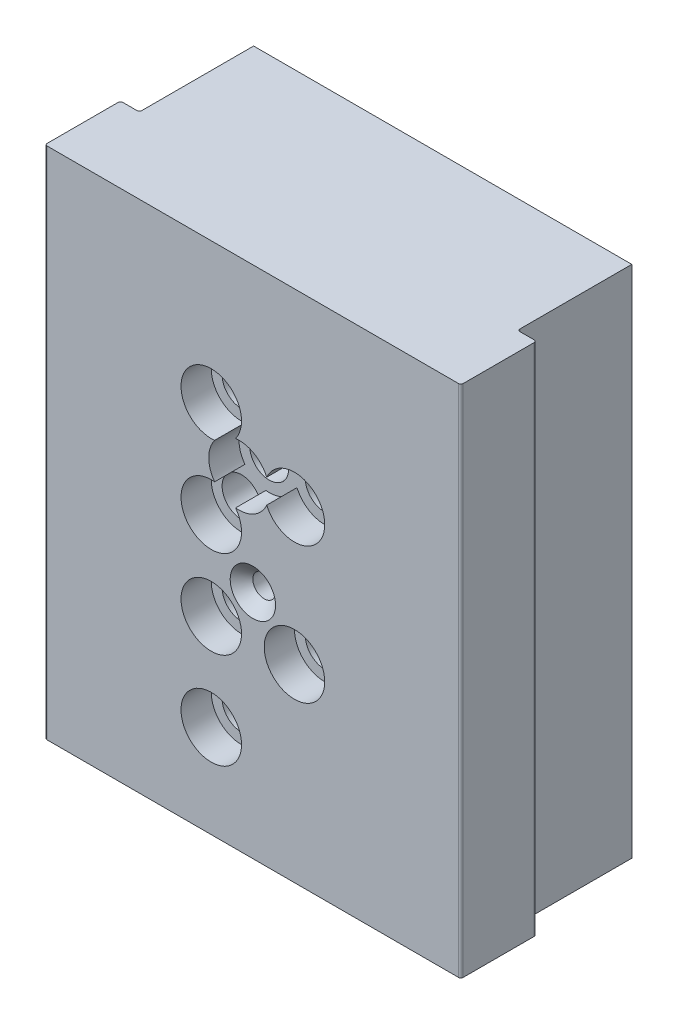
ISO-10303-21;
HEADER;
FILE_DESCRIPTION(('STEP AP214'),'2;1');
FILE_NAME('part.step','',(''),(''),'','','');
FILE_SCHEMA(('AUTOMOTIVE_DESIGN { 1 0 10303 214 1 1 1 1 }'));
ENDSEC;
DATA;
#1=APPLICATION_CONTEXT('core data for automotive mechanical design processes');
#2=APPLICATION_PROTOCOL_DEFINITION('international standard','automotive_design',2000,#1);
#3=PRODUCT_CONTEXT('',#1,'mechanical');
#4=PRODUCT('Part','Part','',(#3));
#5=PRODUCT_RELATED_PRODUCT_CATEGORY('part','',(#4));
#6=PRODUCT_DEFINITION_FORMATION('','',#4);
#7=PRODUCT_DEFINITION_CONTEXT('part definition',#1,'design');
#8=PRODUCT_DEFINITION('design','',#6,#7);
#9=PRODUCT_DEFINITION_SHAPE('','',#8);
#10=(LENGTH_UNIT() NAMED_UNIT(*) SI_UNIT(.MILLI.,.METRE.));
#11=(NAMED_UNIT(*) PLANE_ANGLE_UNIT() SI_UNIT($,.RADIAN.));
#12=(NAMED_UNIT(*) SI_UNIT($,.STERADIAN.) SOLID_ANGLE_UNIT());
#13=UNCERTAINTY_MEASURE_WITH_UNIT(LENGTH_MEASURE(1.E-05),#10,'distance_accuracy_value','');
#14=(GEOMETRIC_REPRESENTATION_CONTEXT(3) GLOBAL_UNCERTAINTY_ASSIGNED_CONTEXT((#13)) GLOBAL_UNIT_ASSIGNED_CONTEXT((#10,
#11,#12)) REPRESENTATION_CONTEXT('',''));
#15=CARTESIAN_POINT('',(0.,0.,0.));
#16=DIRECTION('',(0.,0.,1.));
#17=DIRECTION('',(1.,0.,0.));
#18=AXIS2_PLACEMENT_3D('',#15,#16,#17);
#19=CARTESIAN_POINT('',(-25.,68.,-25.1));
#20=DIRECTION('',(0.,0.,1.));
#21=DIRECTION('',(1.,0.,0.));
#22=AXIS2_PLACEMENT_3D('',#19,#20,#21);
#23=PLANE('',#22);
#24=CARTESIAN_POINT('',(-17.3,60.,-25.1));
#25=DIRECTION('',(0.,0.,1.));
#26=DIRECTION('',(1.,0.,0.));
#27=AXIS2_PLACEMENT_3D('',#24,#25,#26);
#28=CIRCLE('',#27,4.00000000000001);
#29=CARTESIAN_POINT('',(-13.3,60.,-25.1));
#30=VERTEX_POINT('',#29);
#31=EDGE_CURVE('E360',#30,#30,#28,.F.);
#32=ORIENTED_EDGE('',*,*,#31,.F.);
#33=EDGE_LOOP('',(#32));
#34=FACE_BOUND('',#33,.T.);
#35=CARTESIAN_POINT('',(5.49999999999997,25.,-25.1));
#36=DIRECTION('',(0.,0.,1.));
#37=DIRECTION('',(1.,0.,0.));
#38=AXIS2_PLACEMENT_3D('',#35,#36,#37);
#39=CIRCLE('',#38,2.56984153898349);
#40=CARTESIAN_POINT('',(8.06984153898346,25.,-25.1));
#41=VERTEX_POINT('',#40);
#42=EDGE_CURVE('E368',#41,#41,#39,.T.);
#43=ORIENTED_EDGE('',*,*,#42,.T.);
#44=EDGE_LOOP('',(#43));
#45=FACE_BOUND('',#44,.T.);
#46=CARTESIAN_POINT('',(-5.50000000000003,12.3,-25.1));
#47=DIRECTION('',(0.,0.,1.));
#48=DIRECTION('',(1.,0.,0.));
#49=AXIS2_PLACEMENT_3D('',#46,#47,#48);
#50=CIRCLE('',#49,2.56984153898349);
#51=CARTESIAN_POINT('',(-2.93015846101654,12.3,-25.1));
#52=VERTEX_POINT('',#51);
#53=EDGE_CURVE('E888',#52,#52,#50,.T.);
#54=ORIENTED_EDGE('',*,*,#53,.T.);
#55=EDGE_LOOP('',(#54));
#56=FACE_BOUND('',#55,.T.);
#57=CARTESIAN_POINT('',(-5.50000000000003,25.,-25.1));
#58=DIRECTION('',(0.,0.,1.));
#59=DIRECTION('',(1.,0.,0.));
#60=AXIS2_PLACEMENT_3D('',#57,#58,#59);
#61=CIRCLE('',#60,2.56984153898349);
#62=CARTESIAN_POINT('',(-2.93015846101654,25.,-25.1));
#63=VERTEX_POINT('',#62);
#64=EDGE_CURVE('E200',#63,#63,#61,.T.);
#65=ORIENTED_EDGE('',*,*,#64,.T.);
#66=EDGE_LOOP('',(#65));
#67=FACE_BOUND('',#66,.T.);
#68=CARTESIAN_POINT('',(5.5,43.,-25.1));
#69=DIRECTION('',(0.,0.,1.));
#70=DIRECTION('',(1.,0.,0.));
#71=AXIS2_PLACEMENT_3D('',#68,#69,#70);
#72=CIRCLE('',#71,2.57);
#73=CARTESIAN_POINT('',(8.07,43.,-25.1));
#74=VERTEX_POINT('',#73);
#75=EDGE_CURVE('E240',#74,#74,#72,.T.);
#76=ORIENTED_EDGE('',*,*,#75,.T.);
#77=EDGE_LOOP('',(#76));
#78=FACE_BOUND('',#77,.T.);
#79=CARTESIAN_POINT('',(-1.83333333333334,43.,-25.1));
#80=DIRECTION('',(0.,0.,1.));
#81=DIRECTION('',(1.,0.,0.));
#82=AXIS2_PLACEMENT_3D('',#79,#80,#81);
#83=CIRCLE('',#82,2.57);
#84=CARTESIAN_POINT('',(0.736666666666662,43.,-25.1));
#85=VERTEX_POINT('',#84);
#86=EDGE_CURVE('E243',#85,#85,#83,.T.);
#87=ORIENTED_EDGE('',*,*,#86,.T.);
#88=EDGE_LOOP('',(#87));
#89=FACE_BOUND('',#88,.T.);
#90=CARTESIAN_POINT('',(-5.50000000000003,36.6491470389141,-25.1));
#91=DIRECTION('',(0.,0.,1.));
#92=DIRECTION('',(1.,0.,0.));
#93=AXIS2_PLACEMENT_3D('',#90,#91,#92);
#94=CIRCLE('',#93,2.57);
#95=CARTESIAN_POINT('',(-2.93000000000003,36.6491470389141,-25.1));
#96=VERTEX_POINT('',#95);
#97=EDGE_CURVE('E246',#96,#96,#94,.T.);
#98=ORIENTED_EDGE('',*,*,#97,.T.);
#99=EDGE_LOOP('',(#98));
#100=FACE_BOUND('',#99,.T.);
#101=CARTESIAN_POINT('',(-5.50000000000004,49.3508529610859,-25.1));
#102=DIRECTION('',(0.,0.,1.));
#103=DIRECTION('',(1.,0.,0.));
#104=AXIS2_PLACEMENT_3D('',#101,#102,#103);
#105=CIRCLE('',#104,2.57);
#106=CARTESIAN_POINT('',(-2.93000000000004,49.3508529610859,-25.1));
#107=VERTEX_POINT('',#106);
#108=EDGE_CURVE('E249',#107,#107,#105,.T.);
#109=ORIENTED_EDGE('',*,*,#108,.T.);
#110=EDGE_LOOP('',(#109));
#111=FACE_BOUND('',#110,.T.);
#112=CARTESIAN_POINT('',(0.,30.5,-25.1));
#113=DIRECTION('',(0.,0.,1.));
#114=DIRECTION('',(1.,0.,0.));
#115=AXIS2_PLACEMENT_3D('',#112,#113,#114);
#116=CIRCLE('',#115,2.32413016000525);
#117=CARTESIAN_POINT('',(2.32413016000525,30.5,-25.1));
#118=VERTEX_POINT('',#117);
#119=EDGE_CURVE('E256',#118,#118,#116,.T.);
#120=ORIENTED_EDGE('',*,*,#119,.T.);
#121=EDGE_LOOP('',(#120));
#122=FACE_BOUND('',#121,.T.);
#123=DIRECTION('',(-1.,0.,0.));
#124=VECTOR('',#123,1.);
#125=CARTESIAN_POINT('',(-25.,0.,-25.1));
#126=LINE('',#125,#124);
#127=CARTESIAN_POINT('',(25.,0.,-25.1));
#128=VERTEX_POINT('',#127);
#129=CARTESIAN_POINT('',(-25.,0.,-25.1));
#130=VERTEX_POINT('',#129);
#131=EDGE_CURVE('E290',#128,#130,#126,.T.);
#132=ORIENTED_EDGE('',*,*,#131,.T.);
#133=DIRECTION('',(0.,-1.,0.));
#134=VECTOR('',#133,1.);
#135=CARTESIAN_POINT('',(-25.,68.,-25.1));
#136=LINE('',#135,#134);
#137=CARTESIAN_POINT('',(-25.,68.,-25.1));
#138=VERTEX_POINT('',#137);
#139=EDGE_CURVE('E282',#138,#130,#136,.T.);
#140=ORIENTED_EDGE('',*,*,#139,.F.);
#141=DIRECTION('',(-1.,0.,0.));
#142=VECTOR('',#141,1.);
#143=CARTESIAN_POINT('',(-25.,68.,-25.1));
#144=LINE('',#143,#142);
#145=CARTESIAN_POINT('',(25.,68.,-25.1));
#146=VERTEX_POINT('',#145);
#147=EDGE_CURVE('E269',#146,#138,#144,.T.);
#148=ORIENTED_EDGE('',*,*,#147,.F.);
#149=DIRECTION('',(0.,-1.,0.));
#150=VECTOR('',#149,1.);
#151=CARTESIAN_POINT('',(25.,68.,-25.1));
#152=LINE('',#151,#150);
#153=EDGE_CURVE('E304',#146,#128,#152,.T.);
#154=ORIENTED_EDGE('',*,*,#153,.T.);
#155=EDGE_LOOP('',(#132,#140,#148,#154));
#156=FACE_BOUND('',#155,.T.);
#157=CARTESIAN_POINT('',(17.3,8.,-25.1));
#158=DIRECTION('',(0.,0.,1.));
#159=DIRECTION('',(1.,0.,0.));
#160=AXIS2_PLACEMENT_3D('',#157,#158,#159);
#161=CIRCLE('',#160,4.);
#162=CARTESIAN_POINT('',(21.3,8.,-25.1));
#163=VERTEX_POINT('',#162);
#164=EDGE_CURVE('E382',#163,#163,#161,.F.);
#165=ORIENTED_EDGE('',*,*,#164,.F.);
#166=EDGE_LOOP('',(#165));
#167=FACE_BOUND('',#166,.T.);
#168=ADVANCED_FACE('F33',(#34,#45,#56,#67,#78,#89,#100,#111,#122,#156,#167),#23,.F.);
#169=CARTESIAN_POINT('',(5.49999999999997,25.,-25.1));
#170=DIRECTION('',(0.,0.,1.));
#171=DIRECTION('',(1.,0.,0.));
#172=AXIS2_PLACEMENT_3D('',#169,#170,#171);
#173=CYLINDRICAL_SURFACE('',#172,2.56984153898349);
#174=ORIENTED_EDGE('',*,*,#42,.F.);
#175=EDGE_LOOP('',(#174));
#176=FACE_BOUND('',#175,.T.);
#177=CARTESIAN_POINT('',(5.49999999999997,25.,-4.));
#178=DIRECTION('',(0.,0.,1.));
#179=DIRECTION('',(1.,0.,0.));
#180=AXIS2_PLACEMENT_3D('',#177,#178,#179);
#181=CIRCLE('',#180,2.56984153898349);
#182=CARTESIAN_POINT('',(8.06984153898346,25.,-4.));
#183=VERTEX_POINT('',#182);
#184=EDGE_CURVE('E375',#183,#183,#181,.F.);
#185=ORIENTED_EDGE('',*,*,#184,.F.);
#186=EDGE_LOOP('',(#185));
#187=FACE_BOUND('',#186,.T.);
#188=ADVANCED_FACE('F405',(#176,#187),#173,.F.);
#189=CARTESIAN_POINT('',(-5.50000000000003,12.3,-25.1));
#190=DIRECTION('',(0.,0.,1.));
#191=DIRECTION('',(1.,0.,0.));
#192=AXIS2_PLACEMENT_3D('',#189,#190,#191);
#193=CYLINDRICAL_SURFACE('',#192,2.56984153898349);
#194=ORIENTED_EDGE('',*,*,#53,.F.);
#195=EDGE_LOOP('',(#194));
#196=FACE_BOUND('',#195,.T.);
#197=CARTESIAN_POINT('',(-5.50000000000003,12.3,-4.));
#198=DIRECTION('',(0.,0.,1.));
#199=DIRECTION('',(1.,0.,0.));
#200=AXIS2_PLACEMENT_3D('',#197,#198,#199);
#201=CIRCLE('',#200,2.56984153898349);
#202=CARTESIAN_POINT('',(-2.93015846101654,12.3,-4.));
#203=VERTEX_POINT('',#202);
#204=EDGE_CURVE('E370',#203,#203,#201,.F.);
#205=ORIENTED_EDGE('',*,*,#204,.F.);
#206=EDGE_LOOP('',(#205));
#207=FACE_BOUND('',#206,.T.);
#208=ADVANCED_FACE('F411',(#196,#207),#193,.F.);
#209=CARTESIAN_POINT('',(-5.50000000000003,25.,-25.1));
#210=DIRECTION('',(0.,0.,1.));
#211=DIRECTION('',(1.,0.,0.));
#212=AXIS2_PLACEMENT_3D('',#209,#210,#211);
#213=CYLINDRICAL_SURFACE('',#212,2.56984153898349);
#214=ORIENTED_EDGE('',*,*,#64,.F.);
#215=EDGE_LOOP('',(#214));
#216=FACE_BOUND('',#215,.T.);
#217=CARTESIAN_POINT('',(-5.50000000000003,25.,-4.));
#218=DIRECTION('',(0.,0.,1.));
#219=DIRECTION('',(1.,0.,0.));
#220=AXIS2_PLACEMENT_3D('',#217,#218,#219);
#221=CIRCLE('',#220,2.56984153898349);
#222=CARTESIAN_POINT('',(-2.93015846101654,25.,-4.));
#223=VERTEX_POINT('',#222);
#224=EDGE_CURVE('E365',#223,#223,#221,.F.);
#225=ORIENTED_EDGE('',*,*,#224,.F.);
#226=EDGE_LOOP('',(#225));
#227=FACE_BOUND('',#226,.T.);
#228=ADVANCED_FACE('F532',(#216,#227),#213,.F.);
#229=CARTESIAN_POINT('',(-5.50000000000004,49.3508529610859,-25.1));
#230=DIRECTION('',(0.,0.,1.));
#231=DIRECTION('',(1.,0.,0.));
#232=AXIS2_PLACEMENT_3D('',#229,#230,#231);
#233=CYLINDRICAL_SURFACE('',#232,2.57);
#234=ORIENTED_EDGE('',*,*,#108,.F.);
#235=EDGE_LOOP('',(#234));
#236=FACE_BOUND('',#235,.T.);
#237=CARTESIAN_POINT('',(-5.50000000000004,49.3508529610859,-4.));
#238=DIRECTION('',(0.,0.,1.));
#239=DIRECTION('',(1.,0.,0.));
#240=AXIS2_PLACEMENT_3D('',#237,#238,#239);
#241=CIRCLE('',#240,2.57);
#242=CARTESIAN_POINT('',(-2.93000000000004,49.3508529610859,-4.));
#243=VERTEX_POINT('',#242);
#244=EDGE_CURVE('E237',#243,#243,#241,.F.);
#245=ORIENTED_EDGE('',*,*,#244,.F.);
#246=EDGE_LOOP('',(#245));
#247=FACE_BOUND('',#246,.T.);
#248=ADVANCED_FACE('F528',(#236,#247),#233,.F.);
#249=CARTESIAN_POINT('',(-5.50000000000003,36.6491470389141,-25.1));
#250=DIRECTION('',(0.,0.,1.));
#251=DIRECTION('',(1.,0.,0.));
#252=AXIS2_PLACEMENT_3D('',#249,#250,#251);
#253=CYLINDRICAL_SURFACE('',#252,2.57);
#254=ORIENTED_EDGE('',*,*,#97,.F.);
#255=EDGE_LOOP('',(#254));
#256=FACE_BOUND('',#255,.T.);
#257=CARTESIAN_POINT('',(-5.50000000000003,36.6491470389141,-4.));
#258=DIRECTION('',(0.,0.,1.));
#259=DIRECTION('',(1.,0.,0.));
#260=AXIS2_PLACEMENT_3D('',#257,#258,#259);
#261=CIRCLE('',#260,2.57);
#262=CARTESIAN_POINT('',(-2.93000000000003,36.6491470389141,-4.));
#263=VERTEX_POINT('',#262);
#264=EDGE_CURVE('E234',#263,#263,#261,.F.);
#265=ORIENTED_EDGE('',*,*,#264,.F.);
#266=EDGE_LOOP('',(#265));
#267=FACE_BOUND('',#266,.T.);
#268=ADVANCED_FACE('F531',(#256,#267),#253,.F.);
#269=CARTESIAN_POINT('',(-1.83333333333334,43.,-25.1));
#270=DIRECTION('',(0.,0.,1.));
#271=DIRECTION('',(1.,0.,0.));
#272=AXIS2_PLACEMENT_3D('',#269,#270,#271);
#273=CYLINDRICAL_SURFACE('',#272,2.57);
#274=ORIENTED_EDGE('',*,*,#86,.F.);
#275=EDGE_LOOP('',(#274));
#276=FACE_BOUND('',#275,.T.);
#277=CARTESIAN_POINT('',(-1.83333333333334,43.,-4.));
#278=DIRECTION('',(0.,0.,1.));
#279=DIRECTION('',(1.,0.,0.));
#280=AXIS2_PLACEMENT_3D('',#277,#278,#279);
#281=CIRCLE('',#280,2.57);
#282=CARTESIAN_POINT('',(0.736666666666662,43.,-4.));
#283=VERTEX_POINT('',#282);
#284=EDGE_CURVE('E231',#283,#283,#281,.F.);
#285=ORIENTED_EDGE('',*,*,#284,.F.);
#286=EDGE_LOOP('',(#285));
#287=FACE_BOUND('',#286,.T.);
#288=ADVANCED_FACE('F536',(#276,#287),#273,.F.);
#289=CARTESIAN_POINT('',(5.5,43.,-25.1));
#290=DIRECTION('',(0.,0.,1.));
#291=DIRECTION('',(1.,0.,0.));
#292=AXIS2_PLACEMENT_3D('',#289,#290,#291);
#293=CYLINDRICAL_SURFACE('',#292,2.57);
#294=ORIENTED_EDGE('',*,*,#75,.F.);
#295=EDGE_LOOP('',(#294));
#296=FACE_BOUND('',#295,.T.);
#297=CARTESIAN_POINT('',(5.5,43.,-4.));
#298=DIRECTION('',(0.,0.,1.));
#299=DIRECTION('',(1.,0.,0.));
#300=AXIS2_PLACEMENT_3D('',#297,#298,#299);
#301=CIRCLE('',#300,2.57);
#302=CARTESIAN_POINT('',(8.07,43.,-4.));
#303=VERTEX_POINT('',#302);
#304=EDGE_CURVE('E223',#303,#303,#301,.F.);
#305=ORIENTED_EDGE('',*,*,#304,.F.);
#306=EDGE_LOOP('',(#305));
#307=FACE_BOUND('',#306,.T.);
#308=ADVANCED_FACE('F431',(#296,#307),#293,.F.);
#309=CARTESIAN_POINT('',(27.5,68.,-10.));
#310=DIRECTION('',(-1.,0.,0.));
#311=DIRECTION('',(0.,0.,1.));
#312=AXIS2_PLACEMENT_3D('',#309,#310,#311);
#313=PLANE('',#312);
#314=DIRECTION('',(0.,0.,-1.));
#315=VECTOR('',#314,1.);
#316=CARTESIAN_POINT('',(27.5,68.,-10.));
#317=LINE('',#316,#315);
#318=CARTESIAN_POINT('',(27.5,68.,-0.3));
#319=VERTEX_POINT('',#318);
#320=CARTESIAN_POINT('',(27.5,68.,-9.7));
#321=VERTEX_POINT('',#320);
#322=EDGE_CURVE('E260',#319,#321,#317,.T.);
#323=ORIENTED_EDGE('',*,*,#322,.F.);
#324=DIRECTION('',(0.,-1.,0.));
#325=VECTOR('',#324,1.);
#326=CARTESIAN_POINT('',(27.5,68.,-0.3));
#327=LINE('',#326,#325);
#328=CARTESIAN_POINT('',(27.5,0.,-0.3));
#329=VERTEX_POINT('',#328);
#330=EDGE_CURVE('E341',#319,#329,#327,.T.);
#331=ORIENTED_EDGE('',*,*,#330,.T.);
#332=DIRECTION('',(0.,0.,-1.));
#333=VECTOR('',#332,1.);
#334=CARTESIAN_POINT('',(27.5,0.,-10.));
#335=LINE('',#334,#333);
#336=CARTESIAN_POINT('',(27.5,0.,-9.7));
#337=VERTEX_POINT('',#336);
#338=EDGE_CURVE('E259',#329,#337,#335,.T.);
#339=ORIENTED_EDGE('',*,*,#338,.T.);
#340=DIRECTION('',(0.,-1.,0.));
#341=VECTOR('',#340,1.);
#342=CARTESIAN_POINT('',(27.5,68.,-9.7));
#343=LINE('',#342,#341);
#344=EDGE_CURVE('E339',#337,#321,#343,.F.);
#345=ORIENTED_EDGE('',*,*,#344,.T.);
#346=EDGE_LOOP('',(#323,#331,#339,#345));
#347=FACE_BOUND('',#346,.T.);
#348=ADVANCED_FACE('F427',(#347),#313,.F.);
#349=CARTESIAN_POINT('',(27.5,68.,-10.));
#350=DIRECTION('',(0.,0.,1.));
#351=DIRECTION('',(1.,0.,0.));
#352=AXIS2_PLACEMENT_3D('',#349,#350,#351);
#353=PLANE('',#352);
#354=DIRECTION('',(-1.,0.,0.));
#355=VECTOR('',#354,1.);
#356=CARTESIAN_POINT('',(27.5,68.,-10.));
#357=LINE('',#356,#355);
#358=CARTESIAN_POINT('',(27.2,68.,-10.));
#359=VERTEX_POINT('',#358);
#360=CARTESIAN_POINT('',(25.3,68.,-10.));
#361=VERTEX_POINT('',#360);
#362=EDGE_CURVE('E263',#359,#361,#357,.T.);
#363=ORIENTED_EDGE('',*,*,#362,.F.);
#364=DIRECTION('',(0.,-1.,0.));
#365=VECTOR('',#364,1.);
#366=CARTESIAN_POINT('',(27.2,68.,-10.));
#367=LINE('',#366,#365);
#368=CARTESIAN_POINT('',(27.2,0.,-10.));
#369=VERTEX_POINT('',#368);
#370=EDGE_CURVE('E346',#359,#369,#367,.T.);
#371=ORIENTED_EDGE('',*,*,#370,.T.);
#372=DIRECTION('',(-1.,0.,0.));
#373=VECTOR('',#372,1.);
#374=CARTESIAN_POINT('',(27.5,0.,-10.));
#375=LINE('',#374,#373);
#376=CARTESIAN_POINT('',(25.3,0.,-10.));
#377=VERTEX_POINT('',#376);
#378=EDGE_CURVE('E285',#369,#377,#375,.T.);
#379=ORIENTED_EDGE('',*,*,#378,.T.);
#380=DIRECTION('',(0.,-1.,0.));
#381=VECTOR('',#380,1.);
#382=CARTESIAN_POINT('',(25.3,68.,-10.));
#383=LINE('',#382,#381);
#384=EDGE_CURVE('E344',#377,#361,#383,.F.);
#385=ORIENTED_EDGE('',*,*,#384,.T.);
#386=EDGE_LOOP('',(#363,#371,#379,#385));
#387=FACE_BOUND('',#386,.T.);
#388=ADVANCED_FACE('F423',(#387),#353,.F.);
#389=CARTESIAN_POINT('',(25.,68.,-25.1));
#390=DIRECTION('',(-1.,0.,0.));
#391=DIRECTION('',(0.,0.,1.));
#392=AXIS2_PLACEMENT_3D('',#389,#390,#391);
#393=PLANE('',#392);
#394=DIRECTION('',(0.,0.,-1.));
#395=VECTOR('',#394,1.);
#396=CARTESIAN_POINT('',(25.,68.,-25.1));
#397=LINE('',#396,#395);
#398=CARTESIAN_POINT('',(25.,68.,-10.3));
#399=VERTEX_POINT('',#398);
#400=EDGE_CURVE('E267',#399,#146,#397,.T.);
#401=ORIENTED_EDGE('',*,*,#400,.F.);
#402=DIRECTION('',(0.,-1.,0.));
#403=VECTOR('',#402,1.);
#404=CARTESIAN_POINT('',(25.,0.,-10.3));
#405=LINE('',#404,#403);
#406=CARTESIAN_POINT('',(25.,0.,-10.3));
#407=VERTEX_POINT('',#406);
#408=EDGE_CURVE('E349',#399,#407,#405,.T.);
#409=ORIENTED_EDGE('',*,*,#408,.T.);
#410=DIRECTION('',(0.,0.,-1.));
#411=VECTOR('',#410,1.);
#412=CARTESIAN_POINT('',(25.,0.,-25.1));
#413=LINE('',#412,#411);
#414=EDGE_CURVE('E288',#407,#128,#413,.T.);
#415=ORIENTED_EDGE('',*,*,#414,.T.);
#416=ORIENTED_EDGE('',*,*,#153,.F.);
#417=EDGE_LOOP('',(#401,#409,#415,#416));
#418=FACE_BOUND('',#417,.T.);
#419=ADVANCED_FACE('F420',(#418),#393,.F.);
#420=CARTESIAN_POINT('',(-25.,68.,-25.1));
#421=DIRECTION('',(1.,0.,0.));
#422=DIRECTION('',(0.,0.,-1.));
#423=AXIS2_PLACEMENT_3D('',#420,#421,#422);
#424=PLANE('',#423);
#425=DIRECTION('',(0.,0.,1.));
#426=VECTOR('',#425,1.);
#427=CARTESIAN_POINT('',(-25.,0.,-25.1));
#428=LINE('',#427,#426);
#429=CARTESIAN_POINT('',(-25.,0.,-10.3));
#430=VERTEX_POINT('',#429);
#431=EDGE_CURVE('E292',#130,#430,#428,.T.);
#432=ORIENTED_EDGE('',*,*,#431,.T.);
#433=DIRECTION('',(0.,-1.,0.));
#434=VECTOR('',#433,1.);
#435=CARTESIAN_POINT('',(-25.,68.,-10.3));
#436=LINE('',#435,#434);
#437=CARTESIAN_POINT('',(-25.,68.,-10.3));
#438=VERTEX_POINT('',#437);
#439=EDGE_CURVE('E337',#430,#438,#436,.F.);
#440=ORIENTED_EDGE('',*,*,#439,.T.);
#441=DIRECTION('',(0.,0.,1.));
#442=VECTOR('',#441,1.);
#443=CARTESIAN_POINT('',(-25.,68.,-25.1));
#444=LINE('',#443,#442);
#445=EDGE_CURVE('E271',#138,#438,#444,.T.);
#446=ORIENTED_EDGE('',*,*,#445,.F.);
#447=ORIENTED_EDGE('',*,*,#139,.T.);
#448=EDGE_LOOP('',(#432,#440,#446,#447));
#449=FACE_BOUND('',#448,.T.);
#450=ADVANCED_FACE('F418',(#449),#424,.F.);
#451=CARTESIAN_POINT('',(-27.5,68.,-10.));
#452=DIRECTION('',(0.,0.,1.));
#453=DIRECTION('',(1.,0.,0.));
#454=AXIS2_PLACEMENT_3D('',#451,#452,#453);
#455=PLANE('',#454);
#456=DIRECTION('',(-1.,0.,0.));
#457=VECTOR('',#456,1.);
#458=CARTESIAN_POINT('',(-27.5,0.,-10.));
#459=LINE('',#458,#457);
#460=CARTESIAN_POINT('',(-25.3,0.,-10.));
#461=VERTEX_POINT('',#460);
#462=CARTESIAN_POINT('',(-27.2,0.,-10.));
#463=VERTEX_POINT('',#462);
#464=EDGE_CURVE('E295',#461,#463,#459,.T.);
#465=ORIENTED_EDGE('',*,*,#464,.T.);
#466=DIRECTION('',(0.,-1.,0.));
#467=VECTOR('',#466,1.);
#468=CARTESIAN_POINT('',(-27.2,68.,-10.));
#469=LINE('',#468,#467);
#470=CARTESIAN_POINT('',(-27.2,68.,-10.));
#471=VERTEX_POINT('',#470);
#472=EDGE_CURVE('E56',#463,#471,#469,.F.);
#473=ORIENTED_EDGE('',*,*,#472,.T.);
#474=DIRECTION('',(-1.,0.,0.));
#475=VECTOR('',#474,1.);
#476=CARTESIAN_POINT('',(-27.5,68.,-10.));
#477=LINE('',#476,#475);
#478=CARTESIAN_POINT('',(-25.3,68.,-10.));
#479=VERTEX_POINT('',#478);
#480=EDGE_CURVE('E274',#479,#471,#477,.T.);
#481=ORIENTED_EDGE('',*,*,#480,.F.);
#482=DIRECTION('',(0.,-1.,0.));
#483=VECTOR('',#482,1.);
#484=CARTESIAN_POINT('',(-25.3,0.,-10.));
#485=LINE('',#484,#483);
#486=EDGE_CURVE('E333',#479,#461,#485,.T.);
#487=ORIENTED_EDGE('',*,*,#486,.T.);
#488=EDGE_LOOP('',(#465,#473,#481,#487));
#489=FACE_BOUND('',#488,.T.);
#490=ADVANCED_FACE('F484',(#489),#455,.F.);
#491=CARTESIAN_POINT('',(-27.5,68.,-10.));
#492=DIRECTION('',(1.,0.,0.));
#493=DIRECTION('',(0.,0.,-1.));
#494=AXIS2_PLACEMENT_3D('',#491,#492,#493);
#495=PLANE('',#494);
#496=DIRECTION('',(0.,0.,1.));
#497=VECTOR('',#496,1.);
#498=CARTESIAN_POINT('',(-27.5,0.,-10.));
#499=LINE('',#498,#497);
#500=CARTESIAN_POINT('',(-27.5,0.,-9.7));
#501=VERTEX_POINT('',#500);
#502=CARTESIAN_POINT('',(-27.5,0.,-0.3));
#503=VERTEX_POINT('',#502);
#504=EDGE_CURVE('E297',#501,#503,#499,.T.);
#505=ORIENTED_EDGE('',*,*,#504,.T.);
#506=DIRECTION('',(0.,-1.,0.));
#507=VECTOR('',#506,1.);
#508=CARTESIAN_POINT('',(-27.5,68.,-0.3));
#509=LINE('',#508,#507);
#510=CARTESIAN_POINT('',(-27.5,68.,-0.3));
#511=VERTEX_POINT('',#510);
#512=EDGE_CURVE('E323',#503,#511,#509,.F.);
#513=ORIENTED_EDGE('',*,*,#512,.T.);
#514=DIRECTION('',(0.,0.,1.));
#515=VECTOR('',#514,1.);
#516=CARTESIAN_POINT('',(-27.5,68.,-10.));
#517=LINE('',#516,#515);
#518=CARTESIAN_POINT('',(-27.5,68.,-9.7));
#519=VERTEX_POINT('',#518);
#520=EDGE_CURVE('E276',#519,#511,#517,.T.);
#521=ORIENTED_EDGE('',*,*,#520,.F.);
#522=DIRECTION('',(0.,-1.,0.));
#523=VECTOR('',#522,1.);
#524=CARTESIAN_POINT('',(-27.5,68.,-9.7));
#525=LINE('',#524,#523);
#526=EDGE_CURVE('E320',#519,#501,#525,.T.);
#527=ORIENTED_EDGE('',*,*,#526,.T.);
#528=EDGE_LOOP('',(#505,#513,#521,#527));
#529=FACE_BOUND('',#528,.T.);
#530=ADVANCED_FACE('F493',(#529),#495,.F.);
#531=CARTESIAN_POINT('',(-27.5,68.,0.));
#532=DIRECTION('',(0.,0.,-1.));
#533=DIRECTION('',(-1.,0.,0.));
#534=AXIS2_PLACEMENT_3D('',#531,#532,#533);
#535=PLANE('',#534);
#536=CARTESIAN_POINT('',(5.49999999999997,25.,0.));
#537=DIRECTION('',(0.,0.,1.));
#538=DIRECTION('',(1.,0.,0.));
#539=AXIS2_PLACEMENT_3D('',#536,#537,#538);
#540=CIRCLE('',#539,4.);
#541=CARTESIAN_POINT('',(9.49999999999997,25.,0.));
#542=VERTEX_POINT('',#541);
#543=EDGE_CURVE('E874',#542,#542,#540,.T.);
#544=ORIENTED_EDGE('',*,*,#543,.F.);
#545=EDGE_LOOP('',(#544));
#546=FACE_BOUND('',#545,.T.);
#547=CARTESIAN_POINT('',(-5.50000000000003,12.3,0.));
#548=DIRECTION('',(0.,0.,1.));
#549=DIRECTION('',(1.,0.,0.));
#550=AXIS2_PLACEMENT_3D('',#547,#548,#549);
#551=CIRCLE('',#550,4.);
#552=CARTESIAN_POINT('',(-1.50000000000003,12.3,0.));
#553=VERTEX_POINT('',#552);
#554=EDGE_CURVE('E378',#553,#553,#551,.T.);
#555=ORIENTED_EDGE('',*,*,#554,.F.);
#556=EDGE_LOOP('',(#555));
#557=FACE_BOUND('',#556,.T.);
#558=CARTESIAN_POINT('',(-5.50000000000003,25.,0.));
#559=DIRECTION('',(0.,0.,1.));
#560=DIRECTION('',(1.,0.,0.));
#561=AXIS2_PLACEMENT_3D('',#558,#559,#560);
#562=CIRCLE('',#561,4.);
#563=CARTESIAN_POINT('',(-1.50000000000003,25.,0.));
#564=VERTEX_POINT('',#563);
#565=EDGE_CURVE('E373',#564,#564,#562,.T.);
#566=ORIENTED_EDGE('',*,*,#565,.F.);
#567=EDGE_LOOP('',(#566));
#568=FACE_BOUND('',#567,.T.);
#569=CARTESIAN_POINT('',(5.5,43.,0.));
#570=DIRECTION('',(0.,0.,1.));
#571=DIRECTION('',(1.,0.,0.));
#572=AXIS2_PLACEMENT_3D('',#569,#570,#571);
#573=CIRCLE('',#572,4.);
#574=CARTESIAN_POINT('',(1.83333333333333,41.4013894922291,0.));
#575=VERTEX_POINT('',#574);
#576=CARTESIAN_POINT('',(1.83333333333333,44.5986105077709,0.));
#577=VERTEX_POINT('',#576);
#578=EDGE_CURVE('E211',#575,#577,#573,.T.);
#579=ORIENTED_EDGE('',*,*,#578,.F.);
#580=CARTESIAN_POINT('',(-1.83333333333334,43.,0.));
#581=DIRECTION('',(0.,0.,1.));
#582=DIRECTION('',(1.,0.,0.));
#583=AXIS2_PLACEMENT_3D('',#580,#581,#582);
#584=CIRCLE('',#583,4.);
#585=CARTESIAN_POINT('',(-2.28222935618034,39.0252682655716,0.));
#586=VERTEX_POINT('',#585);
#587=EDGE_CURVE('E48',#586,#575,#584,.T.);
#588=ORIENTED_EDGE('',*,*,#587,.F.);
#589=CARTESIAN_POINT('',(-5.50000000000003,36.6491470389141,0.));
#590=DIRECTION('',(0.,0.,1.));
#591=DIRECTION('',(1.,0.,0.));
#592=AXIS2_PLACEMENT_3D('',#589,#590,#591);
#593=CIRCLE('',#592,4.);
#594=CARTESIAN_POINT('',(-5.05110397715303,40.6238787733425,0.));
#595=VERTEX_POINT('',#594);
#596=EDGE_CURVE('E194',#595,#586,#593,.T.);
#597=ORIENTED_EDGE('',*,*,#596,.F.);
#598=CARTESIAN_POINT('',(-1.83333333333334,43.,0.));
#599=DIRECTION('',(0.,0.,1.));
#600=DIRECTION('',(1.,0.,0.));
#601=AXIS2_PLACEMENT_3D('',#598,#599,#600);
#602=CIRCLE('',#601,4.);
#603=CARTESIAN_POINT('',(-5.05110397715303,45.3761212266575,0.));
#604=VERTEX_POINT('',#603);
#605=EDGE_CURVE('E197',#604,#595,#602,.T.);
#606=ORIENTED_EDGE('',*,*,#605,.F.);
#607=CARTESIAN_POINT('',(-5.50000000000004,49.3508529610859,0.));
#608=DIRECTION('',(0.,0.,1.));
#609=DIRECTION('',(1.,0.,0.));
#610=AXIS2_PLACEMENT_3D('',#607,#608,#609);
#611=CIRCLE('',#610,4.);
#612=CARTESIAN_POINT('',(-2.28222935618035,46.9747317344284,0.));
#613=VERTEX_POINT('',#612);
#614=EDGE_CURVE('E216',#613,#604,#611,.T.);
#615=ORIENTED_EDGE('',*,*,#614,.F.);
#616=CARTESIAN_POINT('',(-1.83333333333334,43.,0.));
#617=DIRECTION('',(0.,0.,1.));
#618=DIRECTION('',(1.,0.,0.));
#619=AXIS2_PLACEMENT_3D('',#616,#617,#618);
#620=CIRCLE('',#619,4.);
#621=EDGE_CURVE('E213',#577,#613,#620,.T.);
#622=ORIENTED_EDGE('',*,*,#621,.F.);
#623=EDGE_LOOP('',(#579,#588,#597,#606,#615,#622));
#624=FACE_BOUND('',#623,.T.);
#625=CARTESIAN_POINT('',(0.,30.5,0.));
#626=DIRECTION('',(0.,0.,-1.));
#627=DIRECTION('',(-1.,0.,0.));
#628=AXIS2_PLACEMENT_3D('',#625,#626,#627);
#629=CIRCLE('',#628,3.00000000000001);
#630=CARTESIAN_POINT('',(-3.00000000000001,30.5,0.));
#631=VERTEX_POINT('',#630);
#632=EDGE_CURVE('E255',#631,#631,#629,.T.);
#633=ORIENTED_EDGE('',*,*,#632,.T.);
#634=EDGE_LOOP('',(#633));
#635=FACE_BOUND('',#634,.T.);
#636=DIRECTION('',(1.,0.,0.));
#637=VECTOR('',#636,1.);
#638=CARTESIAN_POINT('',(-27.5,68.,0.));
#639=LINE('',#638,#637);
#640=CARTESIAN_POINT('',(-27.2,68.,0.));
#641=VERTEX_POINT('',#640);
#642=CARTESIAN_POINT('',(27.2,68.,0.));
#643=VERTEX_POINT('',#642);
#644=EDGE_CURVE('E279',#641,#643,#639,.T.);
#645=ORIENTED_EDGE('',*,*,#644,.F.);
#646=DIRECTION('',(0.,-1.,0.));
#647=VECTOR('',#646,1.);
#648=CARTESIAN_POINT('',(-27.2,68.,0.));
#649=LINE('',#648,#647);
#650=CARTESIAN_POINT('',(-27.2,0.,0.));
#651=VERTEX_POINT('',#650);
#652=EDGE_CURVE('E309',#641,#651,#649,.T.);
#653=ORIENTED_EDGE('',*,*,#652,.T.);
#654=DIRECTION('',(1.,0.,0.));
#655=VECTOR('',#654,1.);
#656=CARTESIAN_POINT('',(-27.5,0.,0.));
#657=LINE('',#656,#655);
#658=CARTESIAN_POINT('',(27.2,0.,0.));
#659=VERTEX_POINT('',#658);
#660=EDGE_CURVE('E264',#651,#659,#657,.T.);
#661=ORIENTED_EDGE('',*,*,#660,.T.);
#662=DIRECTION('',(0.,-1.,0.));
#663=VECTOR('',#662,1.);
#664=CARTESIAN_POINT('',(27.2,68.,0.));
#665=LINE('',#664,#663);
#666=EDGE_CURVE('E307',#659,#643,#665,.F.);
#667=ORIENTED_EDGE('',*,*,#666,.T.);
#668=EDGE_LOOP('',(#645,#653,#661,#667));
#669=FACE_BOUND('',#668,.T.);
#670=ADVANCED_FACE('F499',(#546,#557,#568,#624,#635,#669),#535,.F.);
#671=CARTESIAN_POINT('',(0.,68.,0.));
#672=DIRECTION('',(0.,1.,0.));
#673=DIRECTION('',(0.,0.,1.));
#674=AXIS2_PLACEMENT_3D('',#671,#672,#673);
#675=PLANE('',#674);
#676=ORIENTED_EDGE('',*,*,#520,.T.);
#677=CARTESIAN_POINT('',(-27.2,68.,-0.3));
#678=DIRECTION('',(0.,1.,0.));
#679=DIRECTION('',(0.,0.,1.));
#680=AXIS2_PLACEMENT_3D('',#677,#678,#679);
#681=CIRCLE('',#680,0.3);
#682=EDGE_CURVE('E331',#511,#641,#681,.T.);
#683=ORIENTED_EDGE('',*,*,#682,.T.);
#684=ORIENTED_EDGE('',*,*,#644,.T.);
#685=CARTESIAN_POINT('',(27.2,68.,-0.3));
#686=DIRECTION('',(0.,1.,0.));
#687=DIRECTION('',(0.,0.,1.));
#688=AXIS2_PLACEMENT_3D('',#685,#686,#687);
#689=CIRCLE('',#688,0.3);
#690=EDGE_CURVE('E327',#643,#319,#689,.T.);
#691=ORIENTED_EDGE('',*,*,#690,.T.);
#692=ORIENTED_EDGE('',*,*,#322,.T.);
#693=CARTESIAN_POINT('',(27.2,68.,-9.7));
#694=DIRECTION('',(0.,1.,0.));
#695=DIRECTION('',(0.,0.,1.));
#696=AXIS2_PLACEMENT_3D('',#693,#694,#695);
#697=CIRCLE('',#696,0.3);
#698=EDGE_CURVE('E325',#321,#359,#697,.T.);
#699=ORIENTED_EDGE('',*,*,#698,.T.);
#700=ORIENTED_EDGE('',*,*,#362,.T.);
#701=CARTESIAN_POINT('',(25.3,68.,-10.3));
#702=DIRECTION('',(0.,1.,0.));
#703=DIRECTION('',(0.,0.,1.));
#704=AXIS2_PLACEMENT_3D('',#701,#702,#703);
#705=CIRCLE('',#704,0.3);
#706=EDGE_CURVE('E358',#361,#399,#705,.F.);
#707=ORIENTED_EDGE('',*,*,#706,.T.);
#708=ORIENTED_EDGE('',*,*,#400,.T.);
#709=ORIENTED_EDGE('',*,*,#147,.T.);
#710=ORIENTED_EDGE('',*,*,#445,.T.);
#711=CARTESIAN_POINT('',(-25.3,68.,-10.3));
#712=DIRECTION('',(0.,1.,0.));
#713=DIRECTION('',(0.,0.,1.));
#714=AXIS2_PLACEMENT_3D('',#711,#712,#713);
#715=CIRCLE('',#714,0.3);
#716=EDGE_CURVE('E354',#438,#479,#715,.F.);
#717=ORIENTED_EDGE('',*,*,#716,.T.);
#718=ORIENTED_EDGE('',*,*,#480,.T.);
#719=CARTESIAN_POINT('',(-27.2,68.,-9.7));
#720=DIRECTION('',(0.,1.,0.));
#721=DIRECTION('',(0.,0.,1.));
#722=AXIS2_PLACEMENT_3D('',#719,#720,#721);
#723=CIRCLE('',#722,0.3);
#724=EDGE_CURVE('E329',#471,#519,#723,.T.);
#725=ORIENTED_EDGE('',*,*,#724,.T.);
#726=EDGE_LOOP('',(#676,#683,#684,#691,#692,#699,#700,#707,#708,#709,#710,#717,#718,#725));
#727=FACE_BOUND('',#726,.T.);
#728=ADVANCED_FACE('F469',(#727),#675,.T.);
#729=CARTESIAN_POINT('',(0.,0.,0.));
#730=DIRECTION('',(0.,1.,0.));
#731=DIRECTION('',(0.,0.,1.));
#732=AXIS2_PLACEMENT_3D('',#729,#730,#731);
#733=PLANE('',#732);
#734=ORIENTED_EDGE('',*,*,#660,.F.);
#735=CARTESIAN_POINT('',(-27.2,0.,-0.3));
#736=DIRECTION('',(0.,1.,0.));
#737=DIRECTION('',(0.,0.,1.));
#738=AXIS2_PLACEMENT_3D('',#735,#736,#737);
#739=CIRCLE('',#738,0.3);
#740=EDGE_CURVE('E318',#651,#503,#739,.F.);
#741=ORIENTED_EDGE('',*,*,#740,.T.);
#742=ORIENTED_EDGE('',*,*,#504,.F.);
#743=CARTESIAN_POINT('',(-27.2,0.,-9.7));
#744=DIRECTION('',(0.,1.,0.));
#745=DIRECTION('',(0.,0.,1.));
#746=AXIS2_PLACEMENT_3D('',#743,#744,#745);
#747=CIRCLE('',#746,0.3);
#748=EDGE_CURVE('E316',#501,#463,#747,.F.);
#749=ORIENTED_EDGE('',*,*,#748,.T.);
#750=ORIENTED_EDGE('',*,*,#464,.F.);
#751=CARTESIAN_POINT('',(-25.3,0.,-10.3));
#752=DIRECTION('',(0.,1.,0.));
#753=DIRECTION('',(0.,0.,1.));
#754=AXIS2_PLACEMENT_3D('',#751,#752,#753);
#755=CIRCLE('',#754,0.3);
#756=EDGE_CURVE('E352',#461,#430,#755,.T.);
#757=ORIENTED_EDGE('',*,*,#756,.T.);
#758=ORIENTED_EDGE('',*,*,#431,.F.);
#759=ORIENTED_EDGE('',*,*,#131,.F.);
#760=ORIENTED_EDGE('',*,*,#414,.F.);
#761=CARTESIAN_POINT('',(25.3,0.,-10.3));
#762=DIRECTION('',(0.,1.,0.));
#763=DIRECTION('',(0.,0.,1.));
#764=AXIS2_PLACEMENT_3D('',#761,#762,#763);
#765=CIRCLE('',#764,0.3);
#766=EDGE_CURVE('E356',#407,#377,#765,.T.);
#767=ORIENTED_EDGE('',*,*,#766,.T.);
#768=ORIENTED_EDGE('',*,*,#378,.F.);
#769=CARTESIAN_POINT('',(27.2,0.,-9.7));
#770=DIRECTION('',(0.,1.,0.));
#771=DIRECTION('',(0.,0.,1.));
#772=AXIS2_PLACEMENT_3D('',#769,#770,#771);
#773=CIRCLE('',#772,0.3);
#774=EDGE_CURVE('E312',#369,#337,#773,.F.);
#775=ORIENTED_EDGE('',*,*,#774,.T.);
#776=ORIENTED_EDGE('',*,*,#338,.F.);
#777=CARTESIAN_POINT('',(27.2,0.,-0.3));
#778=DIRECTION('',(0.,1.,0.));
#779=DIRECTION('',(0.,0.,1.));
#780=AXIS2_PLACEMENT_3D('',#777,#778,#779);
#781=CIRCLE('',#780,0.3);
#782=EDGE_CURVE('E314',#329,#659,#781,.F.);
#783=ORIENTED_EDGE('',*,*,#782,.T.);
#784=EDGE_LOOP('',(#734,#741,#742,#749,#750,#757,#758,#759,#760,#767,#768,#775,#776,#783));
#785=FACE_BOUND('',#784,.T.);
#786=ADVANCED_FACE('F437',(#785),#733,.F.);
#787=CARTESIAN_POINT('',(-27.2,68.,-0.3));
#788=DIRECTION('',(0.,-1.,0.));
#789=DIRECTION('',(0.,0.,-1.));
#790=AXIS2_PLACEMENT_3D('',#787,#788,#789);
#791=CYLINDRICAL_SURFACE('',#790,0.3);
#792=ORIENTED_EDGE('',*,*,#682,.F.);
#793=ORIENTED_EDGE('',*,*,#512,.F.);
#794=ORIENTED_EDGE('',*,*,#740,.F.);
#795=ORIENTED_EDGE('',*,*,#652,.F.);
#796=EDGE_LOOP('',(#792,#793,#794,#795));
#797=FACE_BOUND('',#796,.T.);
#798=ADVANCED_FACE('F433',(#797),#791,.T.);
#799=CARTESIAN_POINT('',(-27.2,68.,-9.7));
#800=DIRECTION('',(0.,-1.,0.));
#801=DIRECTION('',(0.,0.,-1.));
#802=AXIS2_PLACEMENT_3D('',#799,#800,#801);
#803=CYLINDRICAL_SURFACE('',#802,0.3);
#804=ORIENTED_EDGE('',*,*,#724,.F.);
#805=ORIENTED_EDGE('',*,*,#472,.F.);
#806=ORIENTED_EDGE('',*,*,#748,.F.);
#807=ORIENTED_EDGE('',*,*,#526,.F.);
#808=EDGE_LOOP('',(#804,#805,#806,#807));
#809=FACE_BOUND('',#808,.T.);
#810=ADVANCED_FACE('F436',(#809),#803,.T.);
#811=CARTESIAN_POINT('',(-25.3,68.,-10.3));
#812=DIRECTION('',(0.,1.,0.));
#813=DIRECTION('',(0.,0.,1.));
#814=AXIS2_PLACEMENT_3D('',#811,#812,#813);
#815=CYLINDRICAL_SURFACE('',#814,0.3);
#816=ORIENTED_EDGE('',*,*,#716,.F.);
#817=ORIENTED_EDGE('',*,*,#439,.F.);
#818=ORIENTED_EDGE('',*,*,#756,.F.);
#819=ORIENTED_EDGE('',*,*,#486,.F.);
#820=EDGE_LOOP('',(#816,#817,#818,#819));
#821=FACE_BOUND('',#820,.T.);
#822=ADVANCED_FACE('F441',(#821),#815,.F.);
#823=CARTESIAN_POINT('',(27.2,68.,-0.3));
#824=DIRECTION('',(0.,-1.,0.));
#825=DIRECTION('',(0.,0.,-1.));
#826=AXIS2_PLACEMENT_3D('',#823,#824,#825);
#827=CYLINDRICAL_SURFACE('',#826,0.3);
#828=ORIENTED_EDGE('',*,*,#690,.F.);
#829=ORIENTED_EDGE('',*,*,#666,.F.);
#830=ORIENTED_EDGE('',*,*,#782,.F.);
#831=ORIENTED_EDGE('',*,*,#330,.F.);
#832=EDGE_LOOP('',(#828,#829,#830,#831));
#833=FACE_BOUND('',#832,.T.);
#834=ADVANCED_FACE('F445',(#833),#827,.T.);
#835=CARTESIAN_POINT('',(27.2,68.,-9.7));
#836=DIRECTION('',(0.,-1.,0.));
#837=DIRECTION('',(0.,0.,-1.));
#838=AXIS2_PLACEMENT_3D('',#835,#836,#837);
#839=CYLINDRICAL_SURFACE('',#838,0.3);
#840=ORIENTED_EDGE('',*,*,#698,.F.);
#841=ORIENTED_EDGE('',*,*,#344,.F.);
#842=ORIENTED_EDGE('',*,*,#774,.F.);
#843=ORIENTED_EDGE('',*,*,#370,.F.);
#844=EDGE_LOOP('',(#840,#841,#842,#843));
#845=FACE_BOUND('',#844,.T.);
#846=ADVANCED_FACE('F449',(#845),#839,.T.);
#847=CARTESIAN_POINT('',(25.3,68.,-10.3));
#848=DIRECTION('',(0.,1.,0.));
#849=DIRECTION('',(0.,0.,1.));
#850=AXIS2_PLACEMENT_3D('',#847,#848,#849);
#851=CYLINDRICAL_SURFACE('',#850,0.3);
#852=ORIENTED_EDGE('',*,*,#706,.F.);
#853=ORIENTED_EDGE('',*,*,#384,.F.);
#854=ORIENTED_EDGE('',*,*,#766,.F.);
#855=ORIENTED_EDGE('',*,*,#408,.F.);
#856=EDGE_LOOP('',(#852,#853,#854,#855));
#857=FACE_BOUND('',#856,.T.);
#858=ADVANCED_FACE('F453',(#857),#851,.F.);
#859=CARTESIAN_POINT('',(0.,30.5,-1.5));
#860=DIRECTION('',(0.,0.,-1.));
#861=DIRECTION('',(1.,0.,0.));
#862=AXIS2_PLACEMENT_3D('',#859,#860,#861);
#863=CONICAL_SURFACE('',#862,1.5,0.0349065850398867);
#864=ORIENTED_EDGE('',*,*,#119,.F.);
#865=EDGE_LOOP('',(#864));
#866=FACE_BOUND('',#865,.T.);
#867=CARTESIAN_POINT('',(0.,30.5,-1.5));
#868=DIRECTION('',(0.,0.,-1.));
#869=DIRECTION('',(-1.,0.,0.));
#870=AXIS2_PLACEMENT_3D('',#867,#868,#869);
#871=CIRCLE('',#870,1.5);
#872=CARTESIAN_POINT('',(-1.5,30.5,-1.5));
#873=VERTEX_POINT('',#872);
#874=EDGE_CURVE('E252',#873,#873,#871,.T.);
#875=ORIENTED_EDGE('',*,*,#874,.F.);
#876=EDGE_LOOP('',(#875));
#877=FACE_BOUND('',#876,.T.);
#878=ADVANCED_FACE('F456',(#866,#877),#863,.F.);
#879=CARTESIAN_POINT('',(0.,30.5,-1.5));
#880=DIRECTION('',(0.,0.,1.));
#881=DIRECTION('',(-1.,0.,0.));
#882=AXIS2_PLACEMENT_3D('',#879,#880,#881);
#883=CONICAL_SURFACE('',#882,1.5,0.78539816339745);
#884=ORIENTED_EDGE('',*,*,#874,.T.);
#885=EDGE_LOOP('',(#884));
#886=FACE_BOUND('',#885,.T.);
#887=ORIENTED_EDGE('',*,*,#632,.F.);
#888=EDGE_LOOP('',(#887));
#889=FACE_BOUND('',#888,.T.);
#890=ADVANCED_FACE('F461',(#886,#889),#883,.F.);
#891=CARTESIAN_POINT('',(1.83333333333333,43.,-4.));
#892=DIRECTION('',(0.,0.,1.));
#893=DIRECTION('',(1.,0.,0.));
#894=AXIS2_PLACEMENT_3D('',#891,#892,#893);
#895=PLANE('',#894);
#896=ORIENTED_EDGE('',*,*,#264,.T.);
#897=EDGE_LOOP('',(#896));
#898=FACE_BOUND('',#897,.T.);
#899=ORIENTED_EDGE('',*,*,#304,.T.);
#900=EDGE_LOOP('',(#899));
#901=FACE_BOUND('',#900,.T.);
#902=CARTESIAN_POINT('',(-1.83333333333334,43.,-4.));
#903=DIRECTION('',(0.,0.,1.));
#904=DIRECTION('',(1.,0.,0.));
#905=AXIS2_PLACEMENT_3D('',#902,#903,#904);
#906=CIRCLE('',#905,4.);
#907=CARTESIAN_POINT('',(-2.28222935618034,39.0252682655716,-4.));
#908=VERTEX_POINT('',#907);
#909=CARTESIAN_POINT('',(1.83333333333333,41.4013894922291,-4.));
#910=VERTEX_POINT('',#909);
#911=EDGE_CURVE('E174',#908,#910,#906,.T.);
#912=ORIENTED_EDGE('',*,*,#911,.T.);
#913=CARTESIAN_POINT('',(5.5,43.,-4.));
#914=DIRECTION('',(0.,0.,1.));
#915=DIRECTION('',(1.,0.,0.));
#916=AXIS2_PLACEMENT_3D('',#913,#914,#915);
#917=CIRCLE('',#916,4.);
#918=CARTESIAN_POINT('',(1.83333333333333,44.5986105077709,-4.));
#919=VERTEX_POINT('',#918);
#920=EDGE_CURVE('E183',#910,#919,#917,.T.);
#921=ORIENTED_EDGE('',*,*,#920,.T.);
#922=CARTESIAN_POINT('',(-1.83333333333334,43.,-4.));
#923=DIRECTION('',(0.,0.,1.));
#924=DIRECTION('',(1.,0.,0.));
#925=AXIS2_PLACEMENT_3D('',#922,#923,#924);
#926=CIRCLE('',#925,4.);
#927=CARTESIAN_POINT('',(-2.28222935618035,46.9747317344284,-4.));
#928=VERTEX_POINT('',#927);
#929=EDGE_CURVE('E188',#919,#928,#926,.T.);
#930=ORIENTED_EDGE('',*,*,#929,.T.);
#931=CARTESIAN_POINT('',(-5.50000000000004,49.3508529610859,-4.));
#932=DIRECTION('',(0.,0.,1.));
#933=DIRECTION('',(1.,0.,0.));
#934=AXIS2_PLACEMENT_3D('',#931,#932,#933);
#935=CIRCLE('',#934,4.);
#936=CARTESIAN_POINT('',(-5.05110397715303,45.3761212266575,-4.));
#937=VERTEX_POINT('',#936);
#938=EDGE_CURVE('E204',#928,#937,#935,.T.);
#939=ORIENTED_EDGE('',*,*,#938,.T.);
#940=CARTESIAN_POINT('',(-1.83333333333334,43.,-4.));
#941=DIRECTION('',(0.,0.,1.));
#942=DIRECTION('',(1.,0.,0.));
#943=AXIS2_PLACEMENT_3D('',#940,#941,#942);
#944=CIRCLE('',#943,4.);
#945=CARTESIAN_POINT('',(-5.05110397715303,40.6238787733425,-4.));
#946=VERTEX_POINT('',#945);
#947=EDGE_CURVE('E207',#937,#946,#944,.T.);
#948=ORIENTED_EDGE('',*,*,#947,.T.);
#949=CARTESIAN_POINT('',(-5.50000000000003,36.6491470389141,-4.));
#950=DIRECTION('',(0.,0.,1.));
#951=DIRECTION('',(1.,0.,0.));
#952=AXIS2_PLACEMENT_3D('',#949,#950,#951);
#953=CIRCLE('',#952,4.);
#954=EDGE_CURVE('E180',#946,#908,#953,.T.);
#955=ORIENTED_EDGE('',*,*,#954,.T.);
#956=EDGE_LOOP('',(#912,#921,#930,#939,#948,#955));
#957=FACE_BOUND('',#956,.T.);
#958=ORIENTED_EDGE('',*,*,#284,.T.);
#959=EDGE_LOOP('',(#958));
#960=FACE_BOUND('',#959,.T.);
#961=ORIENTED_EDGE('',*,*,#244,.T.);
#962=EDGE_LOOP('',(#961));
#963=FACE_BOUND('',#962,.T.);
#964=ADVANCED_FACE('F190',(#898,#901,#957,#960,#963),#895,.T.);
#965=CARTESIAN_POINT('',(-1.83333333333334,43.,-4.));
#966=DIRECTION('',(0.,0.,1.));
#967=DIRECTION('',(1.,0.,0.));
#968=AXIS2_PLACEMENT_3D('',#965,#966,#967);
#969=CYLINDRICAL_SURFACE('',#968,4.);
#970=ORIENTED_EDGE('',*,*,#587,.T.);
#971=DIRECTION('',(0.,0.,1.));
#972=VECTOR('',#971,1.);
#973=CARTESIAN_POINT('',(1.83333333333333,41.4013894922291,-4.));
#974=LINE('',#973,#972);
#975=EDGE_CURVE('E170',#910,#575,#974,.T.);
#976=ORIENTED_EDGE('',*,*,#975,.F.);
#977=ORIENTED_EDGE('',*,*,#911,.F.);
#978=DIRECTION('',(0.,0.,1.));
#979=VECTOR('',#978,1.);
#980=CARTESIAN_POINT('',(-2.28222935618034,39.0252682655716,-4.));
#981=LINE('',#980,#979);
#982=EDGE_CURVE('E221',#908,#586,#981,.T.);
#983=ORIENTED_EDGE('',*,*,#982,.T.);
#984=EDGE_LOOP('',(#970,#976,#977,#983));
#985=FACE_BOUND('',#984,.T.);
#986=ADVANCED_FACE('F172',(#985),#969,.F.);
#987=CARTESIAN_POINT('',(-5.50000000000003,36.6491470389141,-4.));
#988=DIRECTION('',(0.,0.,1.));
#989=DIRECTION('',(1.,0.,0.));
#990=AXIS2_PLACEMENT_3D('',#987,#988,#989);
#991=CYLINDRICAL_SURFACE('',#990,4.);
#992=ORIENTED_EDGE('',*,*,#596,.T.);
#993=ORIENTED_EDGE('',*,*,#982,.F.);
#994=ORIENTED_EDGE('',*,*,#954,.F.);
#995=DIRECTION('',(0.,0.,1.));
#996=VECTOR('',#995,1.);
#997=CARTESIAN_POINT('',(-5.05110397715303,40.6238787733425,-4.));
#998=LINE('',#997,#996);
#999=EDGE_CURVE('E224',#946,#595,#998,.T.);
#1000=ORIENTED_EDGE('',*,*,#999,.T.);
#1001=EDGE_LOOP('',(#992,#993,#994,#1000));
#1002=FACE_BOUND('',#1001,.T.);
#1003=ADVANCED_FACE('F546',(#1002),#991,.F.);
#1004=CARTESIAN_POINT('',(-1.83333333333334,43.,-4.));
#1005=DIRECTION('',(0.,0.,1.));
#1006=DIRECTION('',(1.,0.,0.));
#1007=AXIS2_PLACEMENT_3D('',#1004,#1005,#1006);
#1008=CYLINDRICAL_SURFACE('',#1007,4.);
#1009=ORIENTED_EDGE('',*,*,#605,.T.);
#1010=ORIENTED_EDGE('',*,*,#999,.F.);
#1011=ORIENTED_EDGE('',*,*,#947,.F.);
#1012=DIRECTION('',(0.,0.,1.));
#1013=VECTOR('',#1012,1.);
#1014=CARTESIAN_POINT('',(-5.05110397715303,45.3761212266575,-4.));
#1015=LINE('',#1014,#1013);
#1016=EDGE_CURVE('E226',#937,#604,#1015,.T.);
#1017=ORIENTED_EDGE('',*,*,#1016,.T.);
#1018=EDGE_LOOP('',(#1009,#1010,#1011,#1017));
#1019=FACE_BOUND('',#1018,.T.);
#1020=ADVANCED_FACE('F557',(#1019),#1008,.F.);
#1021=CARTESIAN_POINT('',(-5.50000000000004,49.3508529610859,-4.));
#1022=DIRECTION('',(0.,0.,1.));
#1023=DIRECTION('',(1.,0.,0.));
#1024=AXIS2_PLACEMENT_3D('',#1021,#1022,#1023);
#1025=CYLINDRICAL_SURFACE('',#1024,4.);
#1026=ORIENTED_EDGE('',*,*,#614,.T.);
#1027=ORIENTED_EDGE('',*,*,#1016,.F.);
#1028=ORIENTED_EDGE('',*,*,#938,.F.);
#1029=DIRECTION('',(0.,0.,1.));
#1030=VECTOR('',#1029,1.);
#1031=CARTESIAN_POINT('',(-2.28222935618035,46.9747317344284,-4.));
#1032=LINE('',#1031,#1030);
#1033=EDGE_CURVE('E228',#928,#613,#1032,.T.);
#1034=ORIENTED_EDGE('',*,*,#1033,.T.);
#1035=EDGE_LOOP('',(#1026,#1027,#1028,#1034));
#1036=FACE_BOUND('',#1035,.T.);
#1037=ADVANCED_FACE('F553',(#1036),#1025,.F.);
#1038=CARTESIAN_POINT('',(-1.83333333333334,43.,-4.));
#1039=DIRECTION('',(0.,0.,1.));
#1040=DIRECTION('',(1.,0.,0.));
#1041=AXIS2_PLACEMENT_3D('',#1038,#1039,#1040);
#1042=CYLINDRICAL_SURFACE('',#1041,4.);
#1043=ORIENTED_EDGE('',*,*,#621,.T.);
#1044=ORIENTED_EDGE('',*,*,#1033,.F.);
#1045=ORIENTED_EDGE('',*,*,#929,.F.);
#1046=DIRECTION('',(0.,0.,1.));
#1047=VECTOR('',#1046,1.);
#1048=CARTESIAN_POINT('',(1.83333333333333,44.5986105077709,-4.));
#1049=LINE('',#1048,#1047);
#1050=EDGE_CURVE('E179',#919,#577,#1049,.T.);
#1051=ORIENTED_EDGE('',*,*,#1050,.T.);
#1052=EDGE_LOOP('',(#1043,#1044,#1045,#1051));
#1053=FACE_BOUND('',#1052,.T.);
#1054=ADVANCED_FACE('F550',(#1053),#1042,.F.);
#1055=CARTESIAN_POINT('',(5.5,43.,-4.));
#1056=DIRECTION('',(0.,0.,1.));
#1057=DIRECTION('',(1.,0.,0.));
#1058=AXIS2_PLACEMENT_3D('',#1055,#1056,#1057);
#1059=CYLINDRICAL_SURFACE('',#1058,4.);
#1060=ORIENTED_EDGE('',*,*,#578,.T.);
#1061=ORIENTED_EDGE('',*,*,#1050,.F.);
#1062=ORIENTED_EDGE('',*,*,#920,.F.);
#1063=ORIENTED_EDGE('',*,*,#975,.T.);
#1064=EDGE_LOOP('',(#1060,#1061,#1062,#1063));
#1065=FACE_BOUND('',#1064,.T.);
#1066=ADVANCED_FACE('F184',(#1065),#1059,.F.);
#1067=CARTESIAN_POINT('',(1.83333333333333,43.,-4.));
#1068=DIRECTION('',(0.,0.,1.));
#1069=DIRECTION('',(1.,0.,0.));
#1070=AXIS2_PLACEMENT_3D('',#1067,#1068,#1069);
#1071=PLANE('',#1070);
#1072=CARTESIAN_POINT('',(-5.50000000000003,25.,-4.));
#1073=DIRECTION('',(0.,0.,1.));
#1074=DIRECTION('',(1.,0.,0.));
#1075=AXIS2_PLACEMENT_3D('',#1072,#1073,#1074);
#1076=CIRCLE('',#1075,4.);
#1077=CARTESIAN_POINT('',(-1.50000000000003,25.,-4.));
#1078=VERTEX_POINT('',#1077);
#1079=EDGE_CURVE('E369',#1078,#1078,#1076,.F.);
#1080=ORIENTED_EDGE('',*,*,#1079,.F.);
#1081=EDGE_LOOP('',(#1080));
#1082=FACE_BOUND('',#1081,.T.);
#1083=ORIENTED_EDGE('',*,*,#224,.T.);
#1084=EDGE_LOOP('',(#1083));
#1085=FACE_BOUND('',#1084,.T.);
#1086=ADVANCED_FACE('F549',(#1082,#1085),#1071,.T.);
#1087=CARTESIAN_POINT('',(-5.50000000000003,25.,-15.3137084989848));
#1088=DIRECTION('',(0.,0.,1.));
#1089=DIRECTION('',(1.,0.,0.));
#1090=AXIS2_PLACEMENT_3D('',#1087,#1088,#1089);
#1091=CYLINDRICAL_SURFACE('',#1090,4.);
#1092=CARTESIAN_POINT('',(-1.50000000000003,25.,-4.));
#1093=CARTESIAN_POINT('',(-1.50000000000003,25.,-3.95833333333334));
#1094=CARTESIAN_POINT('',(-1.50000000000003,25.,-3.91666666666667));
#1095=CARTESIAN_POINT('',(-1.50000000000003,25.,-3.83333333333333));
#1096=CARTESIAN_POINT('',(-1.50000000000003,25.,-3.79166666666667));
#1097=CARTESIAN_POINT('',(-1.50000000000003,25.,-3.70833333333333));
#1098=CARTESIAN_POINT('',(-1.50000000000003,25.,-3.66666666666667));
#1099=CARTESIAN_POINT('',(-1.50000000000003,25.,-3.58333333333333));
#1100=CARTESIAN_POINT('',(-1.50000000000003,25.,-3.54166666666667));
#1101=CARTESIAN_POINT('',(-1.50000000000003,25.,-3.45833333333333));
#1102=CARTESIAN_POINT('',(-1.50000000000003,25.,-3.41666666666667));
#1103=CARTESIAN_POINT('',(-1.50000000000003,25.,-3.33333333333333));
#1104=CARTESIAN_POINT('',(-1.50000000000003,25.,-3.29166666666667));
#1105=CARTESIAN_POINT('',(-1.50000000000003,25.,-3.20833333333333));
#1106=CARTESIAN_POINT('',(-1.50000000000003,25.,-3.16666666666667));
#1107=CARTESIAN_POINT('',(-1.50000000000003,25.,-3.08333333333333));
#1108=CARTESIAN_POINT('',(-1.50000000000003,25.,-3.04166666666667));
#1109=CARTESIAN_POINT('',(-1.50000000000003,25.,-2.95833333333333));
#1110=CARTESIAN_POINT('',(-1.50000000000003,25.,-2.91666666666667));
#1111=CARTESIAN_POINT('',(-1.50000000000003,25.,-2.83333333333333));
#1112=CARTESIAN_POINT('',(-1.50000000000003,25.,-2.79166666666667));
#1113=CARTESIAN_POINT('',(-1.50000000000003,25.,-2.70833333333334));
#1114=CARTESIAN_POINT('',(-1.50000000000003,25.,-2.66666666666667));
#1115=CARTESIAN_POINT('',(-1.50000000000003,25.,-2.58333333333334));
#1116=CARTESIAN_POINT('',(-1.50000000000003,25.,-2.54166666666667));
#1117=CARTESIAN_POINT('',(-1.50000000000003,25.,-2.45833333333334));
#1118=CARTESIAN_POINT('',(-1.50000000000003,25.,-2.41666666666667));
#1119=CARTESIAN_POINT('',(-1.50000000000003,25.,-2.33333333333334));
#1120=CARTESIAN_POINT('',(-1.50000000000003,25.,-2.29166666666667));
#1121=CARTESIAN_POINT('',(-1.50000000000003,25.,-2.20833333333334));
#1122=CARTESIAN_POINT('',(-1.50000000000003,25.,-2.16666666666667));
#1123=CARTESIAN_POINT('',(-1.50000000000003,25.,-2.08333333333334));
#1124=CARTESIAN_POINT('',(-1.50000000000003,25.,-2.04166666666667));
#1125=CARTESIAN_POINT('',(-1.50000000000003,25.,-1.95833333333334));
#1126=CARTESIAN_POINT('',(-1.50000000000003,25.,-1.91666666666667));
#1127=CARTESIAN_POINT('',(-1.50000000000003,25.,-1.83333333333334));
#1128=CARTESIAN_POINT('',(-1.50000000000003,25.,-1.79166666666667));
#1129=CARTESIAN_POINT('',(-1.50000000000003,25.,-1.70833333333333));
#1130=CARTESIAN_POINT('',(-1.50000000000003,25.,-1.66666666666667));
#1131=CARTESIAN_POINT('',(-1.50000000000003,25.,-1.58333333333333));
#1132=CARTESIAN_POINT('',(-1.50000000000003,25.,-1.54166666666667));
#1133=CARTESIAN_POINT('',(-1.50000000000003,25.,-1.45833333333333));
#1134=CARTESIAN_POINT('',(-1.50000000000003,25.,-1.41666666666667));
#1135=CARTESIAN_POINT('',(-1.50000000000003,25.,-1.33333333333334));
#1136=CARTESIAN_POINT('',(-1.50000000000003,25.,-1.29166666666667));
#1137=CARTESIAN_POINT('',(-1.50000000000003,25.,-1.20833333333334));
#1138=CARTESIAN_POINT('',(-1.50000000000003,25.,-1.16666666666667));
#1139=CARTESIAN_POINT('',(-1.50000000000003,25.,-1.08333333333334));
#1140=CARTESIAN_POINT('',(-1.50000000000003,25.,-1.04166666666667));
#1141=CARTESIAN_POINT('',(-1.50000000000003,25.,-0.958333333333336));
#1142=CARTESIAN_POINT('',(-1.50000000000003,25.,-0.916666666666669));
#1143=CARTESIAN_POINT('',(-1.50000000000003,25.,-0.833333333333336));
#1144=CARTESIAN_POINT('',(-1.50000000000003,25.,-0.791666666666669));
#1145=CARTESIAN_POINT('',(-1.50000000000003,25.,-0.708333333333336));
#1146=CARTESIAN_POINT('',(-1.50000000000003,25.,-0.666666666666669));
#1147=CARTESIAN_POINT('',(-1.50000000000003,25.,-0.583333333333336));
#1148=CARTESIAN_POINT('',(-1.50000000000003,25.,-0.541666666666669));
#1149=CARTESIAN_POINT('',(-1.50000000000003,25.,-0.458333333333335));
#1150=CARTESIAN_POINT('',(-1.50000000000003,25.,-0.416666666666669));
#1151=CARTESIAN_POINT('',(-1.50000000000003,25.,-0.333333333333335));
#1152=CARTESIAN_POINT('',(-1.50000000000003,25.,-0.291666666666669));
#1153=CARTESIAN_POINT('',(-1.50000000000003,25.,-0.208333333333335));
#1154=CARTESIAN_POINT('',(-1.50000000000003,25.,-0.166666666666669));
#1155=CARTESIAN_POINT('',(-1.50000000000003,25.,-0.0833333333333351));
#1156=CARTESIAN_POINT('',(-1.50000000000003,25.,-0.0416666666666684));
#1157=CARTESIAN_POINT('',(-1.50000000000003,25.,0.));
#1158=B_SPLINE_CURVE_WITH_KNOTS('',3,(#1092,#1093,#1094,#1095,#1096,#1097,#1098,#1099,#1100,
#1101,#1102,#1103,#1104,#1105,#1106,#1107,#1108,#1109,#1110,#1111,#1112,#1113,#1114,#1115,#1116,
#1117,#1118,#1119,#1120,#1121,#1122,#1123,#1124,#1125,#1126,#1127,#1128,#1129,#1130,#1131,#1132,
#1133,#1134,#1135,#1136,#1137,#1138,#1139,#1140,#1141,#1142,#1143,#1144,#1145,#1146,#1147,#1148,
#1149,#1150,#1151,#1152,#1153,#1154,#1155,#1156,#1157),.UNSPECIFIED.,.F.,.F.,(4,2,2,2,2,2,2,2,2,
2,2,2,2,2,2,2,2,2,2,2,2,2,2,2,2,2,2,2,2,2,2,2,4),(0.,0.125,0.25,0.375,0.5,0.625000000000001,
0.750000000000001,0.875000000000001,1.,1.125,1.25,1.375,1.5,1.625,1.75,1.875,2.,2.125,2.25,
2.375,2.5,2.625,2.75,2.875,3.,3.125,3.25,3.375,3.5,3.625,3.75,3.875,4.),.UNSPECIFIED.);
#1159=EDGE_CURVE('BSEAM574',#1078,#564,#1158,.T.);
#1160=ORIENTED_EDGE('',*,*,#1079,.T.);
#1161=ORIENTED_EDGE('',*,*,#565,.T.);
#1162=ORIENTED_EDGE('',*,*,#1159,.T.);
#1163=ORIENTED_EDGE('',*,*,#1159,.F.);
#1164=EDGE_LOOP('',(#1160,#1162,#1161,#1163));
#1165=FACE_BOUND('',#1164,.T.);
#1166=ADVANCED_FACE('F574',(#1165),#1091,.F.);
#1167=CARTESIAN_POINT('',(1.83333333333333,43.,-4.));
#1168=DIRECTION('',(0.,0.,1.));
#1169=DIRECTION('',(1.,0.,0.));
#1170=AXIS2_PLACEMENT_3D('',#1167,#1168,#1169);
#1171=PLANE('',#1170);
#1172=CARTESIAN_POINT('',(-5.50000000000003,12.3,-4.));
#1173=DIRECTION('',(0.,0.,1.));
#1174=DIRECTION('',(1.,0.,0.));
#1175=AXIS2_PLACEMENT_3D('',#1172,#1173,#1174);
#1176=CIRCLE('',#1175,4.);
#1177=CARTESIAN_POINT('',(-1.50000000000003,12.3,-4.));
#1178=VERTEX_POINT('',#1177);
#1179=EDGE_CURVE('E374',#1178,#1178,#1176,.F.);
#1180=ORIENTED_EDGE('',*,*,#1179,.F.);
#1181=EDGE_LOOP('',(#1180));
#1182=FACE_BOUND('',#1181,.T.);
#1183=ORIENTED_EDGE('',*,*,#204,.T.);
#1184=EDGE_LOOP('',(#1183));
#1185=FACE_BOUND('',#1184,.T.);
#1186=ADVANCED_FACE('F577',(#1182,#1185),#1171,.T.);
#1187=CARTESIAN_POINT('',(-5.50000000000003,12.3,-15.3137084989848));
#1188=DIRECTION('',(0.,0.,1.));
#1189=DIRECTION('',(1.,0.,0.));
#1190=AXIS2_PLACEMENT_3D('',#1187,#1188,#1189);
#1191=CYLINDRICAL_SURFACE('',#1190,4.);
#1192=CARTESIAN_POINT('',(-1.50000000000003,12.3,-4.));
#1193=CARTESIAN_POINT('',(-1.50000000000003,12.3,-3.95833333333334));
#1194=CARTESIAN_POINT('',(-1.50000000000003,12.3,-3.91666666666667));
#1195=CARTESIAN_POINT('',(-1.50000000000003,12.3,-3.83333333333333));
#1196=CARTESIAN_POINT('',(-1.50000000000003,12.3,-3.79166666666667));
#1197=CARTESIAN_POINT('',(-1.50000000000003,12.3,-3.70833333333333));
#1198=CARTESIAN_POINT('',(-1.50000000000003,12.3,-3.66666666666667));
#1199=CARTESIAN_POINT('',(-1.50000000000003,12.3,-3.58333333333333));
#1200=CARTESIAN_POINT('',(-1.50000000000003,12.3,-3.54166666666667));
#1201=CARTESIAN_POINT('',(-1.50000000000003,12.3,-3.45833333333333));
#1202=CARTESIAN_POINT('',(-1.50000000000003,12.3,-3.41666666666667));
#1203=CARTESIAN_POINT('',(-1.50000000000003,12.3,-3.33333333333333));
#1204=CARTESIAN_POINT('',(-1.50000000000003,12.3,-3.29166666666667));
#1205=CARTESIAN_POINT('',(-1.50000000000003,12.3,-3.20833333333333));
#1206=CARTESIAN_POINT('',(-1.50000000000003,12.3,-3.16666666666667));
#1207=CARTESIAN_POINT('',(-1.50000000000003,12.3,-3.08333333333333));
#1208=CARTESIAN_POINT('',(-1.50000000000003,12.3,-3.04166666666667));
#1209=CARTESIAN_POINT('',(-1.50000000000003,12.3,-2.95833333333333));
#1210=CARTESIAN_POINT('',(-1.50000000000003,12.3,-2.91666666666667));
#1211=CARTESIAN_POINT('',(-1.50000000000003,12.3,-2.83333333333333));
#1212=CARTESIAN_POINT('',(-1.50000000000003,12.3,-2.79166666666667));
#1213=CARTESIAN_POINT('',(-1.50000000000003,12.3,-2.70833333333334));
#1214=CARTESIAN_POINT('',(-1.50000000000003,12.3,-2.66666666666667));
#1215=CARTESIAN_POINT('',(-1.50000000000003,12.3,-2.58333333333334));
#1216=CARTESIAN_POINT('',(-1.50000000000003,12.3,-2.54166666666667));
#1217=CARTESIAN_POINT('',(-1.50000000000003,12.3,-2.45833333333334));
#1218=CARTESIAN_POINT('',(-1.50000000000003,12.3,-2.41666666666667));
#1219=CARTESIAN_POINT('',(-1.50000000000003,12.3,-2.33333333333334));
#1220=CARTESIAN_POINT('',(-1.50000000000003,12.3,-2.29166666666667));
#1221=CARTESIAN_POINT('',(-1.50000000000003,12.3,-2.20833333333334));
#1222=CARTESIAN_POINT('',(-1.50000000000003,12.3,-2.16666666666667));
#1223=CARTESIAN_POINT('',(-1.50000000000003,12.3,-2.08333333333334));
#1224=CARTESIAN_POINT('',(-1.50000000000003,12.3,-2.04166666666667));
#1225=CARTESIAN_POINT('',(-1.50000000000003,12.3,-1.95833333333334));
#1226=CARTESIAN_POINT('',(-1.50000000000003,12.3,-1.91666666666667));
#1227=CARTESIAN_POINT('',(-1.50000000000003,12.3,-1.83333333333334));
#1228=CARTESIAN_POINT('',(-1.50000000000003,12.3,-1.79166666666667));
#1229=CARTESIAN_POINT('',(-1.50000000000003,12.3,-1.70833333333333));
#1230=CARTESIAN_POINT('',(-1.50000000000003,12.3,-1.66666666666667));
#1231=CARTESIAN_POINT('',(-1.50000000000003,12.3,-1.58333333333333));
#1232=CARTESIAN_POINT('',(-1.50000000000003,12.3,-1.54166666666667));
#1233=CARTESIAN_POINT('',(-1.50000000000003,12.3,-1.45833333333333));
#1234=CARTESIAN_POINT('',(-1.50000000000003,12.3,-1.41666666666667));
#1235=CARTESIAN_POINT('',(-1.50000000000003,12.3,-1.33333333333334));
#1236=CARTESIAN_POINT('',(-1.50000000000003,12.3,-1.29166666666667));
#1237=CARTESIAN_POINT('',(-1.50000000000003,12.3,-1.20833333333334));
#1238=CARTESIAN_POINT('',(-1.50000000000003,12.3,-1.16666666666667));
#1239=CARTESIAN_POINT('',(-1.50000000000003,12.3,-1.08333333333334));
#1240=CARTESIAN_POINT('',(-1.50000000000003,12.3,-1.04166666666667));
#1241=CARTESIAN_POINT('',(-1.50000000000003,12.3,-0.958333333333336));
#1242=CARTESIAN_POINT('',(-1.50000000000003,12.3,-0.916666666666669));
#1243=CARTESIAN_POINT('',(-1.50000000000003,12.3,-0.833333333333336));
#1244=CARTESIAN_POINT('',(-1.50000000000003,12.3,-0.791666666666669));
#1245=CARTESIAN_POINT('',(-1.50000000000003,12.3,-0.708333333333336));
#1246=CARTESIAN_POINT('',(-1.50000000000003,12.3,-0.666666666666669));
#1247=CARTESIAN_POINT('',(-1.50000000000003,12.3,-0.583333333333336));
#1248=CARTESIAN_POINT('',(-1.50000000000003,12.3,-0.541666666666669));
#1249=CARTESIAN_POINT('',(-1.50000000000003,12.3,-0.458333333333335));
#1250=CARTESIAN_POINT('',(-1.50000000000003,12.3,-0.416666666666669));
#1251=CARTESIAN_POINT('',(-1.50000000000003,12.3,-0.333333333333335));
#1252=CARTESIAN_POINT('',(-1.50000000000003,12.3,-0.291666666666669));
#1253=CARTESIAN_POINT('',(-1.50000000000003,12.3,-0.208333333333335));
#1254=CARTESIAN_POINT('',(-1.50000000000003,12.3,-0.166666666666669));
#1255=CARTESIAN_POINT('',(-1.50000000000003,12.3,-0.0833333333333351));
#1256=CARTESIAN_POINT('',(-1.50000000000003,12.3,-0.0416666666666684));
#1257=CARTESIAN_POINT('',(-1.50000000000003,12.3,0.));
#1258=B_SPLINE_CURVE_WITH_KNOTS('',3,(#1192,#1193,#1194,#1195,#1196,#1197,#1198,#1199,#1200,
#1201,#1202,#1203,#1204,#1205,#1206,#1207,#1208,#1209,#1210,#1211,#1212,#1213,#1214,#1215,#1216,
#1217,#1218,#1219,#1220,#1221,#1222,#1223,#1224,#1225,#1226,#1227,#1228,#1229,#1230,#1231,#1232,
#1233,#1234,#1235,#1236,#1237,#1238,#1239,#1240,#1241,#1242,#1243,#1244,#1245,#1246,#1247,#1248,
#1249,#1250,#1251,#1252,#1253,#1254,#1255,#1256,#1257),.UNSPECIFIED.,.F.,.F.,(4,2,2,2,2,2,2,2,2,
2,2,2,2,2,2,2,2,2,2,2,2,2,2,2,2,2,2,2,2,2,2,2,4),(0.,0.125,0.25,0.375,0.5,0.625000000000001,
0.750000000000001,0.875000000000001,1.,1.125,1.25,1.375,1.5,1.625,1.75,1.875,2.,2.125,2.25,
2.375,2.5,2.625,2.75,2.875,3.,3.125,3.25,3.375,3.5,3.625,3.75,3.875,4.),.UNSPECIFIED.);
#1259=EDGE_CURVE('BSEAM582',#1178,#553,#1258,.T.);
#1260=ORIENTED_EDGE('',*,*,#1179,.T.);
#1261=ORIENTED_EDGE('',*,*,#554,.T.);
#1262=ORIENTED_EDGE('',*,*,#1259,.T.);
#1263=ORIENTED_EDGE('',*,*,#1259,.F.);
#1264=EDGE_LOOP('',(#1260,#1262,#1261,#1263));
#1265=FACE_BOUND('',#1264,.T.);
#1266=ADVANCED_FACE('F582',(#1265),#1191,.F.);
#1267=CARTESIAN_POINT('',(1.83333333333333,43.,-4.));
#1268=DIRECTION('',(0.,0.,1.));
#1269=DIRECTION('',(1.,0.,0.));
#1270=AXIS2_PLACEMENT_3D('',#1267,#1268,#1269);
#1271=PLANE('',#1270);
#1272=CARTESIAN_POINT('',(5.49999999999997,25.,-4.));
#1273=DIRECTION('',(0.,0.,1.));
#1274=DIRECTION('',(1.,0.,0.));
#1275=AXIS2_PLACEMENT_3D('',#1272,#1273,#1274);
#1276=CIRCLE('',#1275,4.);
#1277=CARTESIAN_POINT('',(9.49999999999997,25.,-4.));
#1278=VERTEX_POINT('',#1277);
#1279=EDGE_CURVE('E379',#1278,#1278,#1276,.F.);
#1280=ORIENTED_EDGE('',*,*,#1279,.F.);
#1281=EDGE_LOOP('',(#1280));
#1282=FACE_BOUND('',#1281,.T.);
#1283=ORIENTED_EDGE('',*,*,#184,.T.);
#1284=EDGE_LOOP('',(#1283));
#1285=FACE_BOUND('',#1284,.T.);
#1286=ADVANCED_FACE('F585',(#1282,#1285),#1271,.T.);
#1287=CARTESIAN_POINT('',(5.49999999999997,25.,-15.3137084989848));
#1288=DIRECTION('',(0.,0.,1.));
#1289=DIRECTION('',(1.,0.,0.));
#1290=AXIS2_PLACEMENT_3D('',#1287,#1288,#1289);
#1291=CYLINDRICAL_SURFACE('',#1290,4.);
#1292=CARTESIAN_POINT('',(9.49999999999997,25.,-4.));
#1293=CARTESIAN_POINT('',(9.49999999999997,25.,-3.95833333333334));
#1294=CARTESIAN_POINT('',(9.49999999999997,25.,-3.91666666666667));
#1295=CARTESIAN_POINT('',(9.49999999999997,25.,-3.83333333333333));
#1296=CARTESIAN_POINT('',(9.49999999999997,25.,-3.79166666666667));
#1297=CARTESIAN_POINT('',(9.49999999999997,25.,-3.70833333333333));
#1298=CARTESIAN_POINT('',(9.49999999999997,25.,-3.66666666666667));
#1299=CARTESIAN_POINT('',(9.49999999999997,25.,-3.58333333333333));
#1300=CARTESIAN_POINT('',(9.49999999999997,25.,-3.54166666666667));
#1301=CARTESIAN_POINT('',(9.49999999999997,25.,-3.45833333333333));
#1302=CARTESIAN_POINT('',(9.49999999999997,25.,-3.41666666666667));
#1303=CARTESIAN_POINT('',(9.49999999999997,25.,-3.33333333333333));
#1304=CARTESIAN_POINT('',(9.49999999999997,25.,-3.29166666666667));
#1305=CARTESIAN_POINT('',(9.49999999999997,25.,-3.20833333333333));
#1306=CARTESIAN_POINT('',(9.49999999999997,25.,-3.16666666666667));
#1307=CARTESIAN_POINT('',(9.49999999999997,25.,-3.08333333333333));
#1308=CARTESIAN_POINT('',(9.49999999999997,25.,-3.04166666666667));
#1309=CARTESIAN_POINT('',(9.49999999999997,25.,-2.95833333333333));
#1310=CARTESIAN_POINT('',(9.49999999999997,25.,-2.91666666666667));
#1311=CARTESIAN_POINT('',(9.49999999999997,25.,-2.83333333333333));
#1312=CARTESIAN_POINT('',(9.49999999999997,25.,-2.79166666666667));
#1313=CARTESIAN_POINT('',(9.49999999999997,25.,-2.70833333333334));
#1314=CARTESIAN_POINT('',(9.49999999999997,25.,-2.66666666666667));
#1315=CARTESIAN_POINT('',(9.49999999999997,25.,-2.58333333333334));
#1316=CARTESIAN_POINT('',(9.49999999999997,25.,-2.54166666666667));
#1317=CARTESIAN_POINT('',(9.49999999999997,25.,-2.45833333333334));
#1318=CARTESIAN_POINT('',(9.49999999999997,25.,-2.41666666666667));
#1319=CARTESIAN_POINT('',(9.49999999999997,25.,-2.33333333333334));
#1320=CARTESIAN_POINT('',(9.49999999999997,25.,-2.29166666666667));
#1321=CARTESIAN_POINT('',(9.49999999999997,25.,-2.20833333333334));
#1322=CARTESIAN_POINT('',(9.49999999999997,25.,-2.16666666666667));
#1323=CARTESIAN_POINT('',(9.49999999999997,25.,-2.08333333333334));
#1324=CARTESIAN_POINT('',(9.49999999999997,25.,-2.04166666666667));
#1325=CARTESIAN_POINT('',(9.49999999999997,25.,-1.95833333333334));
#1326=CARTESIAN_POINT('',(9.49999999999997,25.,-1.91666666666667));
#1327=CARTESIAN_POINT('',(9.49999999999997,25.,-1.83333333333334));
#1328=CARTESIAN_POINT('',(9.49999999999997,25.,-1.79166666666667));
#1329=CARTESIAN_POINT('',(9.49999999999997,25.,-1.70833333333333));
#1330=CARTESIAN_POINT('',(9.49999999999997,25.,-1.66666666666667));
#1331=CARTESIAN_POINT('',(9.49999999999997,25.,-1.58333333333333));
#1332=CARTESIAN_POINT('',(9.49999999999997,25.,-1.54166666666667));
#1333=CARTESIAN_POINT('',(9.49999999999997,25.,-1.45833333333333));
#1334=CARTESIAN_POINT('',(9.49999999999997,25.,-1.41666666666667));
#1335=CARTESIAN_POINT('',(9.49999999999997,25.,-1.33333333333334));
#1336=CARTESIAN_POINT('',(9.49999999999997,25.,-1.29166666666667));
#1337=CARTESIAN_POINT('',(9.49999999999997,25.,-1.20833333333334));
#1338=CARTESIAN_POINT('',(9.49999999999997,25.,-1.16666666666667));
#1339=CARTESIAN_POINT('',(9.49999999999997,25.,-1.08333333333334));
#1340=CARTESIAN_POINT('',(9.49999999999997,25.,-1.04166666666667));
#1341=CARTESIAN_POINT('',(9.49999999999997,25.,-0.958333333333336));
#1342=CARTESIAN_POINT('',(9.49999999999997,25.,-0.916666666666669));
#1343=CARTESIAN_POINT('',(9.49999999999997,25.,-0.833333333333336));
#1344=CARTESIAN_POINT('',(9.49999999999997,25.,-0.791666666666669));
#1345=CARTESIAN_POINT('',(9.49999999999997,25.,-0.708333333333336));
#1346=CARTESIAN_POINT('',(9.49999999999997,25.,-0.666666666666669));
#1347=CARTESIAN_POINT('',(9.49999999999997,25.,-0.583333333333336));
#1348=CARTESIAN_POINT('',(9.49999999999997,25.,-0.541666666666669));
#1349=CARTESIAN_POINT('',(9.49999999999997,25.,-0.458333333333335));
#1350=CARTESIAN_POINT('',(9.49999999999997,25.,-0.416666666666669));
#1351=CARTESIAN_POINT('',(9.49999999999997,25.,-0.333333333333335));
#1352=CARTESIAN_POINT('',(9.49999999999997,25.,-0.291666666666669));
#1353=CARTESIAN_POINT('',(9.49999999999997,25.,-0.208333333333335));
#1354=CARTESIAN_POINT('',(9.49999999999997,25.,-0.166666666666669));
#1355=CARTESIAN_POINT('',(9.49999999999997,25.,-0.0833333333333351));
#1356=CARTESIAN_POINT('',(9.49999999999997,25.,-0.0416666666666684));
#1357=CARTESIAN_POINT('',(9.49999999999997,25.,0.));
#1358=B_SPLINE_CURVE_WITH_KNOTS('',3,(#1292,#1293,#1294,#1295,#1296,#1297,#1298,#1299,#1300,
#1301,#1302,#1303,#1304,#1305,#1306,#1307,#1308,#1309,#1310,#1311,#1312,#1313,#1314,#1315,#1316,
#1317,#1318,#1319,#1320,#1321,#1322,#1323,#1324,#1325,#1326,#1327,#1328,#1329,#1330,#1331,#1332,
#1333,#1334,#1335,#1336,#1337,#1338,#1339,#1340,#1341,#1342,#1343,#1344,#1345,#1346,#1347,#1348,
#1349,#1350,#1351,#1352,#1353,#1354,#1355,#1356,#1357),.UNSPECIFIED.,.F.,.F.,(4,2,2,2,2,2,2,2,2,
2,2,2,2,2,2,2,2,2,2,2,2,2,2,2,2,2,2,2,2,2,2,2,4),(0.,0.125,0.25,0.375,0.5,0.625000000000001,
0.750000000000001,0.875000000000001,1.,1.125,1.25,1.375,1.5,1.625,1.75,1.875,2.,2.125,2.25,
2.375,2.5,2.625,2.75,2.875,3.,3.125,3.25,3.375,3.5,3.625,3.75,3.875,4.),.UNSPECIFIED.);
#1359=EDGE_CURVE('BSEAM590',#1278,#542,#1358,.T.);
#1360=ORIENTED_EDGE('',*,*,#1279,.T.);
#1361=ORIENTED_EDGE('',*,*,#543,.T.);
#1362=ORIENTED_EDGE('',*,*,#1359,.T.);
#1363=ORIENTED_EDGE('',*,*,#1359,.F.);
#1364=EDGE_LOOP('',(#1360,#1362,#1361,#1363));
#1365=FACE_BOUND('',#1364,.T.);
#1366=ADVANCED_FACE('F590',(#1365),#1291,.F.);
#1367=CARTESIAN_POINT('',(-17.3,60.,-25.1));
#1368=DIRECTION('',(0.,0.,1.));
#1369=DIRECTION('',(-1.,0.,0.));
#1370=AXIS2_PLACEMENT_3D('',#1367,#1368,#1369);
#1371=CONICAL_SURFACE('',#1370,4.00000000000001,0.0872664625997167);
#1372=CARTESIAN_POINT('',(-17.3,60.,-28.6019026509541));
#1373=DIRECTION('',(0.,0.,1.));
#1374=DIRECTION('',(1.,0.,0.));
#1375=AXIS2_PLACEMENT_3D('',#1372,#1373,#1374);
#1376=CIRCLE('',#1375,3.69362321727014);
#1377=CARTESIAN_POINT('',(-13.6063767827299,60.,-28.6019026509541));
#1378=VERTEX_POINT('',#1377);
#1379=EDGE_CURVE('E11',#1378,#1378,#1376,.T.);
#1380=ORIENTED_EDGE('',*,*,#1379,.T.);
#1381=EDGE_LOOP('',(#1380));
#1382=FACE_BOUND('',#1381,.T.);
#1383=ORIENTED_EDGE('',*,*,#31,.T.);
#1384=EDGE_LOOP('',(#1383));
#1385=FACE_BOUND('',#1384,.T.);
#1386=ADVANCED_FACE('F593',(#1382,#1385),#1371,.T.);
#1387=CARTESIAN_POINT('',(-17.3,60.,-29.1));
#1388=DIRECTION('',(0.,0.,-1.));
#1389=DIRECTION('',(-1.,0.,0.));
#1390=AXIS2_PLACEMENT_3D('',#1387,#1388,#1389);
#1391=PLANE('',#1390);
#1392=CARTESIAN_POINT('',(-17.3,60.,-29.1));
#1393=DIRECTION('',(0.,0.,-1.));
#1394=DIRECTION('',(-1.,0.,0.));
#1395=AXIS2_PLACEMENT_3D('',#1392,#1393,#1394);
#1396=CIRCLE('',#1395,3.10001391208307);
#1397=CARTESIAN_POINT('',(-20.4000139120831,60.,-29.1));
#1398=VERTEX_POINT('',#1397);
#1399=EDGE_CURVE('E41',#1398,#1398,#1396,.T.);
#1400=ORIENTED_EDGE('',*,*,#1399,.T.);
#1401=EDGE_LOOP('',(#1400));
#1402=FACE_BOUND('',#1401,.T.);
#1403=ADVANCED_FACE('F393',(#1402),#1391,.T.);
#1404=CARTESIAN_POINT('',(17.3,8.,-25.1));
#1405=DIRECTION('',(0.,0.,1.));
#1406=DIRECTION('',(-1.,0.,0.));
#1407=AXIS2_PLACEMENT_3D('',#1404,#1405,#1406);
#1408=CONICAL_SURFACE('',#1407,4.,0.0872664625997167);
#1409=CARTESIAN_POINT('',(17.3,8.,-28.6019026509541));
#1410=DIRECTION('',(0.,0.,1.));
#1411=DIRECTION('',(1.,0.,0.));
#1412=AXIS2_PLACEMENT_3D('',#1409,#1410,#1411);
#1413=CIRCLE('',#1412,3.69362321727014);
#1414=CARTESIAN_POINT('',(20.9936232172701,8.,-28.6019026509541));
#1415=VERTEX_POINT('',#1414);
#1416=EDGE_CURVE('E388',#1415,#1415,#1413,.T.);
#1417=ORIENTED_EDGE('',*,*,#1416,.T.);
#1418=EDGE_LOOP('',(#1417));
#1419=FACE_BOUND('',#1418,.T.);
#1420=ORIENTED_EDGE('',*,*,#164,.T.);
#1421=EDGE_LOOP('',(#1420));
#1422=FACE_BOUND('',#1421,.T.);
#1423=ADVANCED_FACE('F603',(#1419,#1422),#1408,.T.);
#1424=CARTESIAN_POINT('',(17.3,8.,-29.1));
#1425=DIRECTION('',(0.,0.,-1.));
#1426=DIRECTION('',(-1.,0.,0.));
#1427=AXIS2_PLACEMENT_3D('',#1424,#1425,#1426);
#1428=PLANE('',#1427);
#1429=CARTESIAN_POINT('',(17.3,8.,-29.1));
#1430=DIRECTION('',(0.,0.,-1.));
#1431=DIRECTION('',(-1.,0.,0.));
#1432=AXIS2_PLACEMENT_3D('',#1429,#1430,#1431);
#1433=CIRCLE('',#1432,3.10001391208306);
#1434=CARTESIAN_POINT('',(14.1999860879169,8.,-29.1));
#1435=VERTEX_POINT('',#1434);
#1436=EDGE_CURVE('E385',#1435,#1435,#1433,.T.);
#1437=ORIENTED_EDGE('',*,*,#1436,.T.);
#1438=EDGE_LOOP('',(#1437));
#1439=FACE_BOUND('',#1438,.T.);
#1440=ADVANCED_FACE('F401',(#1439),#1428,.T.);
#1441=CARTESIAN_POINT('',(17.3,8.,-29.1));
#1442=DIRECTION('',(0.,0.,1.));
#1443=DIRECTION('',(1.,0.,0.));
#1444=AXIS2_PLACEMENT_3D('',#1441,#1442,#1443);
#1445=CONICAL_SURFACE('',#1444,3.10001391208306,0.87266462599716);
#1446=ORIENTED_EDGE('',*,*,#1416,.F.);
#1447=EDGE_LOOP('',(#1446));
#1448=FACE_BOUND('',#1447,.T.);
#1449=ORIENTED_EDGE('',*,*,#1436,.F.);
#1450=EDGE_LOOP('',(#1449));
#1451=FACE_BOUND('',#1450,.T.);
#1452=ADVANCED_FACE('F396',(#1448,#1451),#1445,.T.);
#1453=CARTESIAN_POINT('',(-17.3,60.,-29.1));
#1454=DIRECTION('',(0.,0.,1.));
#1455=DIRECTION('',(1.,0.,0.));
#1456=AXIS2_PLACEMENT_3D('',#1453,#1454,#1455);
#1457=CONICAL_SURFACE('',#1456,3.10001391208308,0.87266462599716);
#1458=ORIENTED_EDGE('',*,*,#1379,.F.);
#1459=EDGE_LOOP('',(#1458));
#1460=FACE_BOUND('',#1459,.T.);
#1461=ORIENTED_EDGE('',*,*,#1399,.F.);
#1462=EDGE_LOOP('',(#1461));
#1463=FACE_BOUND('',#1462,.T.);
#1464=ADVANCED_FACE('F35',(#1460,#1463),#1457,.T.);
#1465=CLOSED_SHELL('',(#168,#188,#208,#228,#248,#268,#288,#308,#348,#388,#419,#450,#490,#530,
#670,#728,#786,#798,#810,#822,#834,#846,#858,#878,#890,#964,#986,#1003,#1020,#1037,#1054,#1066,
#1086,#1166,#1186,#1266,#1286,#1366,#1386,#1403,#1423,#1440,#1452,#1464));
#1466=MANIFOLD_SOLID_BREP('B2',#1465);
#1467=ADVANCED_BREP_SHAPE_REPRESENTATION('',(#18,#1466),#14);
#1468=SHAPE_DEFINITION_REPRESENTATION(#9,#1467);
ENDSEC;
END-ISO-10303-21;
